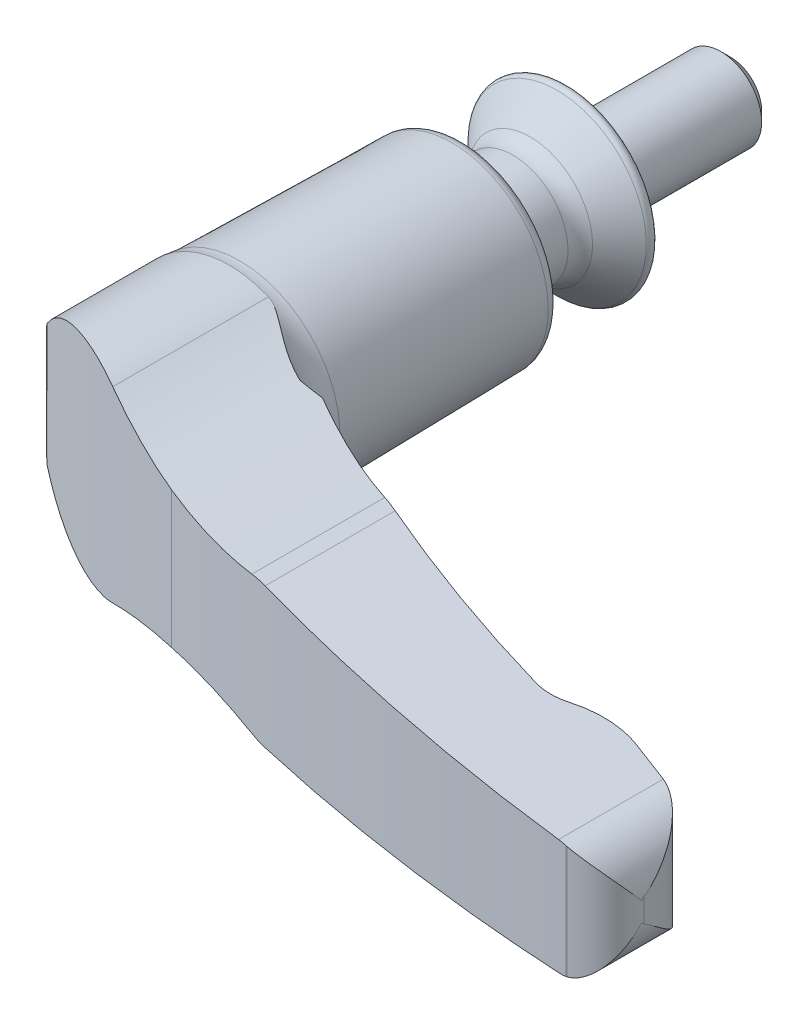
ISO-10303-21;
HEADER;
FILE_DESCRIPTION(('STEP AP214'),'2;1');
FILE_NAME('part.step','',(''),(''),'','','');
FILE_SCHEMA(('AUTOMOTIVE_DESIGN { 1 0 10303 214 1 1 1 1 }'));
ENDSEC;
DATA;
#1=APPLICATION_CONTEXT('core data for automotive mechanical design processes');
#2=APPLICATION_PROTOCOL_DEFINITION('international standard','automotive_design',2000,#1);
#3=PRODUCT_CONTEXT('',#1,'mechanical');
#4=PRODUCT('Part','Part','',(#3));
#5=PRODUCT_RELATED_PRODUCT_CATEGORY('part','',(#4));
#6=PRODUCT_DEFINITION_FORMATION('','',#4);
#7=PRODUCT_DEFINITION_CONTEXT('part definition',#1,'design');
#8=PRODUCT_DEFINITION('design','',#6,#7);
#9=PRODUCT_DEFINITION_SHAPE('','',#8);
#10=(LENGTH_UNIT() NAMED_UNIT(*) SI_UNIT(.MILLI.,.METRE.));
#11=(NAMED_UNIT(*) PLANE_ANGLE_UNIT() SI_UNIT($,.RADIAN.));
#12=(NAMED_UNIT(*) SI_UNIT($,.STERADIAN.) SOLID_ANGLE_UNIT());
#13=UNCERTAINTY_MEASURE_WITH_UNIT(LENGTH_MEASURE(1.E-05),#10,'distance_accuracy_value','');
#14=(GEOMETRIC_REPRESENTATION_CONTEXT(3) GLOBAL_UNCERTAINTY_ASSIGNED_CONTEXT((#13)) GLOBAL_UNIT_ASSIGNED_CONTEXT((#10,
#11,#12)) REPRESENTATION_CONTEXT('',''));
#15=CARTESIAN_POINT('',(0.,0.,0.));
#16=DIRECTION('',(0.,0.,1.));
#17=DIRECTION('',(1.,0.,0.));
#18=AXIS2_PLACEMENT_3D('',#15,#16,#17);
#19=CARTESIAN_POINT('',(-12.2494442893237,-13.45,40.2250875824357));
#20=DIRECTION('',(0.,0.,1.));
#21=DIRECTION('',(-1.,0.,0.));
#22=AXIS2_PLACEMENT_3D('',#19,#20,#21);
#23=PLANE('',#22);
#24=DIRECTION('',(0.,1.,0.));
#25=VECTOR('',#24,1.);
#26=CARTESIAN_POINT('',(-12.2494442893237,-13.45,40.2250875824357));
#27=LINE('',#26,#25);
#28=CARTESIAN_POINT('',(-12.2494442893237,-1.12726551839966,40.2250875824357));
#29=VERTEX_POINT('',#28);
#30=CARTESIAN_POINT('',(-12.2494442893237,0.,40.2250875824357));
#31=VERTEX_POINT('',#30);
#32=EDGE_CURVE('E175',#29,#31,#27,.T.);
#33=ORIENTED_EDGE('',*,*,#32,.T.);
#34=CARTESIAN_POINT('',(-1.62642046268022E-13,0.,40.2250875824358));
#35=DIRECTION('',(0.,0.,1.));
#36=DIRECTION('',(-1.,0.,0.));
#37=AXIS2_PLACEMENT_3D('',#34,#35,#36);
#38=CIRCLE('',#37,12.2494442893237);
#39=EDGE_CURVE('E178',#31,#31,#38,.F.);
#40=ORIENTED_EDGE('',*,*,#39,.F.);
#41=CARTESIAN_POINT('',(-12.2494442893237,1.12726551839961,40.2250875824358));
#42=VERTEX_POINT('',#41);
#43=EDGE_CURVE('E185',#31,#42,#27,.T.);
#44=ORIENTED_EDGE('',*,*,#43,.T.);
#45=CARTESIAN_POINT('',(0.,0.,40.2250875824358));
#46=DIRECTION('',(0.,0.,-1.));
#47=DIRECTION('',(1.,0.,0.));
#48=AXIS2_PLACEMENT_3D('',#45,#46,#47);
#49=CIRCLE('',#48,12.3012037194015);
#50=EDGE_CURVE('E180',#42,#29,#49,.T.);
#51=ORIENTED_EDGE('',*,*,#50,.T.);
#52=EDGE_LOOP('',(#33,#40,#44,#51));
#53=FACE_BOUND('',#52,.T.);
#54=ADVANCED_FACE('F14',(#53),#23,.F.);
#55=CARTESIAN_POINT('',(-12.3990914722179,-13.45,48.8947231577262));
#56=DIRECTION('',(0.999851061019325,0.,0.0172584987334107));
#57=DIRECTION('',(-0.0172584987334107,0.,0.999851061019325));
#58=AXIS2_PLACEMENT_3D('',#55,#56,#57);
#59=PLANE('',#58);
#60=ORIENTED_EDGE('',*,*,#43,.F.);
#61=ORIENTED_EDGE('',*,*,#32,.F.);
#62=CARTESIAN_POINT('',(-12.2494408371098,-1.12726105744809,40.2248875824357));
#63=CARTESIAN_POINT('',(-12.2501546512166,-1.12801102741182,40.2662415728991));
#64=CARTESIAN_POINT('',(-12.2508608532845,-1.13338949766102,40.3071545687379));
#65=CARTESIAN_POINT('',(-12.2522296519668,-1.15131266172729,40.3864543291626));
#66=CARTESIAN_POINT('',(-12.2528928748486,-1.16369170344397,40.4248773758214));
#67=CARTESIAN_POINT('',(-12.254538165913,-1.20206398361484,40.520195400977));
#68=CARTESIAN_POINT('',(-12.255493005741,-1.23180007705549,40.575512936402));
#69=CARTESIAN_POINT('',(-12.257344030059,-1.29909643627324,40.6827498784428));
#70=CARTESIAN_POINT('',(-12.2582382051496,-1.33683049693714,40.7345528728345));
#71=CARTESIAN_POINT('',(-12.2604895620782,-1.44052319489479,40.8649826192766));
#72=CARTESIAN_POINT('',(-12.2618006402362,-1.50977612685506,40.9409384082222));
#73=CARTESIAN_POINT('',(-12.264338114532,-1.65349391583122,41.0879440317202));
#74=CARTESIAN_POINT('',(-12.2655642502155,-1.72797350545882,41.1589787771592));
#75=CARTESIAN_POINT('',(-12.2678450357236,-1.87254522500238,41.2911134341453));
#76=CARTESIAN_POINT('',(-12.268904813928,-1.94236687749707,41.3525104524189));
#77=CARTESIAN_POINT('',(-12.2709847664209,-2.08326818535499,41.4730100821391));
#78=CARTESIAN_POINT('',(-12.2720051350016,-2.15433817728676,41.5321239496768));
#79=CARTESIAN_POINT('',(-12.2730148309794,-2.22587171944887,41.5906195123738));
#80=B_SPLINE_CURVE_WITH_KNOTS('',3,(#62,#63,#64,#65,#66,#67,#68,#69,#70,#71,#72,#73,#74,#75,#76,
#77,#78,#79),.UNSPECIFIED.,.F.,.F.,(4,2,2,2,2,2,2,2,4),(0.,0.123330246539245,0.243857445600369,
0.431247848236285,0.623227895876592,0.931023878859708,1.23972530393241,1.51862793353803,
1.79591047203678),.UNSPECIFIED.);
#81=CARTESIAN_POINT('',(-12.271249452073,-2.10212675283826,41.4883443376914));
#82=VERTEX_POINT('',#81);
#83=EDGE_CURVE('E399',#29,#82,#80,.T.);
#84=ORIENTED_EDGE('',*,*,#83,.T.);
#85=CARTESIAN_POINT('',(0.,0.,-669.432227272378));
#86=DIRECTION('',(0.999851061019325,0.,0.0172584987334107));
#87=DIRECTION('',(0.0172584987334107,0.,-0.999851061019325));
#88=AXIS2_PLACEMENT_3D('',#85,#86,#87);
#89=ELLIPSE('',#88,721.383718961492,12.45);
#90=CARTESIAN_POINT('',(-12.3990914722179,-1.12473581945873,48.8947231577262));
#91=VERTEX_POINT('',#90);
#92=EDGE_CURVE('E239',#82,#91,#89,.F.);
#93=ORIENTED_EDGE('',*,*,#92,.T.);
#94=DIRECTION('',(0.,1.,0.));
#95=VECTOR('',#94,1.);
#96=CARTESIAN_POINT('',(-12.3990914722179,-13.45,48.8947231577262));
#97=LINE('',#96,#95);
#98=CARTESIAN_POINT('',(-12.3990914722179,1.12473581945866,48.8947231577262));
#99=VERTEX_POINT('',#98);
#100=EDGE_CURVE('E184',#91,#99,#97,.T.);
#101=ORIENTED_EDGE('',*,*,#100,.T.);
#102=CARTESIAN_POINT('',(0.,0.,-669.432227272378));
#103=DIRECTION('',(0.999851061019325,0.,0.0172584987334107));
#104=DIRECTION('',(0.0172584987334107,0.,-0.999851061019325));
#105=AXIS2_PLACEMENT_3D('',#102,#103,#104);
#106=ELLIPSE('',#105,721.383718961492,12.45);
#107=CARTESIAN_POINT('',(-12.271249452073,2.10212675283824,41.4883443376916));
#108=VERTEX_POINT('',#107);
#109=EDGE_CURVE('E263',#99,#108,#106,.F.);
#110=ORIENTED_EDGE('',*,*,#109,.T.);
#111=CARTESIAN_POINT('',(-12.2730148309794,2.2258717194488,41.5906195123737));
#112=CARTESIAN_POINT('',(-12.2723484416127,2.17857656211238,41.5520130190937));
#113=CARTESIAN_POINT('',(-12.2716768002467,2.13153645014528,41.5131022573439));
#114=CARTESIAN_POINT('',(-12.2703199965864,2.03804940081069,41.4344974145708));
#115=CARTESIAN_POINT('',(-12.269634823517,1.99160298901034,41.3948027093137));
#116=CARTESIAN_POINT('',(-12.2675030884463,1.84986894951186,41.2713031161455));
#117=CARTESIAN_POINT('',(-12.2660309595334,1.75583214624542,41.1860170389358));
#118=CARTESIAN_POINT('',(-12.2637374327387,1.61936868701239,41.0531442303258));
#119=CARTESIAN_POINT('',(-12.2629577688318,1.574598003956,41.0079753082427));
#120=CARTESIAN_POINT('',(-12.2613598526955,1.48744881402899,40.9154018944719));
#121=CARTESIAN_POINT('',(-12.2605416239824,1.44506888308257,40.8679987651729));
#122=CARTESIAN_POINT('',(-12.2588634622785,1.36463549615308,40.7707764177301));
#123=CARTESIAN_POINT('',(-12.2580043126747,1.32652790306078,40.7210025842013));
#124=CARTESIAN_POINT('',(-12.2562147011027,1.25655247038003,40.6173235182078));
#125=CARTESIAN_POINT('',(-12.2552845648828,1.22465826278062,40.5634371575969));
#126=CARTESIAN_POINT('',(-12.2536883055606,1.18138793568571,40.4709597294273));
#127=CARTESIAN_POINT('',(-12.2530490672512,1.16676743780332,40.4339262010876));
#128=CARTESIAN_POINT('',(-12.2517389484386,1.14385333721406,40.3580259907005));
#129=CARTESIAN_POINT('',(-12.251068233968,1.13552979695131,40.3191689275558));
#130=CARTESIAN_POINT('',(-12.2500751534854,1.12891545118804,40.2616359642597));
#131=CARTESIAN_POINT('',(-12.2497582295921,1.12764004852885,40.2432753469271));
#132=CARTESIAN_POINT('',(-12.2494408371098,1.12726105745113,40.2248875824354));
#133=B_SPLINE_CURVE_WITH_KNOTS('',3,(#111,#112,#113,#114,#115,#116,#117,#118,#119,#120,#121,
#122,#123,#124,#125,#126,#127,#128,#129,#130,#131,#132),.UNSPECIFIED.,.F.,.F.,(4,2,2,2,2,2,2,2,
2,2,4),(0.,0.183152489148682,0.366457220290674,0.747103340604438,0.937859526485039,
1.12850085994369,1.31635856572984,1.50340080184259,1.62247471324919,1.74097889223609,
1.79613687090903),.UNSPECIFIED.);
#134=EDGE_CURVE('E190',#108,#42,#133,.T.);
#135=ORIENTED_EDGE('',*,*,#134,.T.);
#136=EDGE_LOOP('',(#60,#61,#84,#93,#101,#110,#135));
#137=FACE_BOUND('',#136,.T.);
#138=ADVANCED_FACE('F188',(#137),#59,.F.);
#139=CARTESIAN_POINT('',(111.767919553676,-13.45,-139.797819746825));
#140=DIRECTION('',(0.,1.,0.));
#141=DIRECTION('',(-1.,0.,0.));
#142=AXIS2_PLACEMENT_3D('',#139,#140,#141);
#143=CYLINDRICAL_SURFACE('',#142,208.999999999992);
#144=DIRECTION('',(0.,1.,0.));
#145=VECTOR('',#144,1.);
#146=CARTESIAN_POINT('',(15.7999999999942,-13.45,45.8662812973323));
#147=LINE('',#146,#145);
#148=CARTESIAN_POINT('',(15.8,-8.43613014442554,45.8662812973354));
#149=VERTEX_POINT('',#148);
#150=CARTESIAN_POINT('',(15.8,0.,45.8662812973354));
#151=VERTEX_POINT('',#150);
#152=EDGE_CURVE('E191',#149,#151,#147,.T.);
#153=ORIENTED_EDGE('',*,*,#152,.T.);
#154=DIRECTION('',(0.,1.,0.));
#155=VECTOR('',#154,1.);
#156=CARTESIAN_POINT('',(15.8,-13.45,45.8662812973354));
#157=LINE('',#156,#155);
#158=CARTESIAN_POINT('',(15.7999999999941,8.43613014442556,45.8662812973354));
#159=VERTEX_POINT('',#158);
#160=EDGE_CURVE('E413',#159,#151,#157,.F.);
#161=ORIENTED_EDGE('',*,*,#160,.F.);
#162=CARTESIAN_POINT('',(15.7999999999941,8.43613014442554,45.8662812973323));
#163=CARTESIAN_POINT('',(16.3870365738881,8.34717375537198,46.1697176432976));
#164=CARTESIAN_POINT('',(16.9767713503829,8.26904045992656,46.4710139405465));
#165=CARTESIAN_POINT('',(18.161091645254,8.13475115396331,47.0689822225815));
#166=CARTESIAN_POINT('',(18.7556773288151,8.07859589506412,47.3656540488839));
#167=CARTESIAN_POINT('',(20.5395968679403,7.94407204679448,48.2451118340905));
#168=CARTESIAN_POINT('',(21.7352391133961,7.89871013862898,48.8205177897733));
#169=CARTESIAN_POINT('',(24.1374209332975,7.89893976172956,49.9484747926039));
#170=CARTESIAN_POINT('',(25.3439611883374,7.94453701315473,50.5010244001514));
#171=CARTESIAN_POINT('',(27.1599173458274,8.0830634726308,51.3119106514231));
#172=CARTESIAN_POINT('',(27.7678474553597,8.14117035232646,51.5798888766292));
#173=CARTESIAN_POINT('',(28.9839481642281,8.28117670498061,52.1090693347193));
#174=CARTESIAN_POINT('',(29.5921187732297,8.36307725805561,52.370271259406));
#175=CARTESIAN_POINT('',(30.2000000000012,8.45699782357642,52.6279438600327));
#176=B_SPLINE_CURVE_WITH_KNOTS('',3,(#162,#163,#164,#165,#166,#167,#168,#169,#170,#171,#172,
#173,#174,#175),.UNSPECIFIED.,.F.,.F.,(4,2,2,2,2,2,4),(0.,2.00016069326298,4.00038978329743,
7.97994863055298,11.9597577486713,13.9600808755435,15.9604948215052),.UNSPECIFIED.);
#177=CARTESIAN_POINT('',(30.2000000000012,8.45699782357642,52.6279438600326));
#178=VERTEX_POINT('',#177);
#179=EDGE_CURVE('E264',#159,#178,#176,.T.);
#180=ORIENTED_EDGE('',*,*,#179,.T.);
#181=CARTESIAN_POINT('',(32.4002231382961,8.59297245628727,53.5458348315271));
#182=CARTESIAN_POINT('',(32.2157966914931,8.59945246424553,53.4701291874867));
#183=CARTESIAN_POINT('',(32.0313583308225,8.60144694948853,53.3941076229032));
#184=CARTESIAN_POINT('',(31.6631700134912,8.59650662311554,53.2417318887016));
#185=CARTESIAN_POINT('',(31.4794194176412,8.58958963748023,53.1653786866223));
#186=CARTESIAN_POINT('',(30.9288846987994,8.55552869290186,52.9356990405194));
#187=CARTESIAN_POINT('',(30.5630943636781,8.51506518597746,52.7818661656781));
#188=CARTESIAN_POINT('',(30.2000000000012,8.45699782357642,52.6279438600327));
#189=B_SPLINE_CURVE_WITH_KNOTS('',3,(#181,#182,#183,#184,#185,#186,#187,#188),.UNSPECIFIED.,.F.,
.F.,(4,2,2,4),(0.,0.598316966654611,1.19543895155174,2.3905773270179),.UNSPECIFIED.);
#190=CARTESIAN_POINT('',(32.4002231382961,8.59297245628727,53.5458348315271));
#191=VERTEX_POINT('',#190);
#192=EDGE_CURVE('E342',#191,#178,#189,.T.);
#193=ORIENTED_EDGE('',*,*,#192,.F.);
#194=CARTESIAN_POINT('',(111.767919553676,5.80486876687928,-139.797819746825));
#195=DIRECTION('',(-0.0351072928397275,-0.999383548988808,0.));
#196=DIRECTION('',(-0.999383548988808,0.0351072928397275,0.));
#197=AXIS2_PLACEMENT_3D('',#194,#195,#196);
#198=ELLIPSE('',#197,209.128917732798,208.999999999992);
#199=CARTESIAN_POINT('',(58.4999999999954,7.67611474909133,62.2999999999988));
#200=VERTEX_POINT('',#199);
#201=EDGE_CURVE('E350',#200,#191,#198,.T.);
#202=ORIENTED_EDGE('',*,*,#201,.F.);
#203=DIRECTION('',(0.,1.,0.));
#204=VECTOR('',#203,1.);
#205=CARTESIAN_POINT('',(58.4999999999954,-13.45,62.2999999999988));
#206=LINE('',#205,#204);
#207=CARTESIAN_POINT('',(58.4999999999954,-7.67611474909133,62.2999999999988));
#208=VERTEX_POINT('',#207);
#209=EDGE_CURVE('E193',#208,#200,#206,.T.);
#210=ORIENTED_EDGE('',*,*,#209,.F.);
#211=CARTESIAN_POINT('',(111.767919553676,-5.80486876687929,-139.797819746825));
#212=DIRECTION('',(-0.0351072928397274,0.999383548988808,0.));
#213=DIRECTION('',(0.999383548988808,0.0351072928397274,0.));
#214=AXIS2_PLACEMENT_3D('',#211,#212,#213);
#215=ELLIPSE('',#214,209.128917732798,208.999999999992);
#216=CARTESIAN_POINT('',(32.4002231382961,-8.59297245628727,53.5458348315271));
#217=VERTEX_POINT('',#216);
#218=EDGE_CURVE('E817',#217,#208,#215,.T.);
#219=ORIENTED_EDGE('',*,*,#218,.F.);
#220=CARTESIAN_POINT('',(30.2000000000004,-8.45699782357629,52.6279438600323));
#221=CARTESIAN_POINT('',(30.5630943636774,-8.51506518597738,52.7818661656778));
#222=CARTESIAN_POINT('',(30.9288846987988,-8.55552869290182,52.9356990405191));
#223=CARTESIAN_POINT('',(31.4794194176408,-8.58958963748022,53.1653786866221));
#224=CARTESIAN_POINT('',(31.6631700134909,-8.59650662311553,53.2417318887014));
#225=CARTESIAN_POINT('',(32.0313583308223,-8.60144694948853,53.3941076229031));
#226=CARTESIAN_POINT('',(32.215796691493,-8.59945246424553,53.4701291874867));
#227=CARTESIAN_POINT('',(32.4002231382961,-8.59297245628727,53.5458348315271));
#228=B_SPLINE_CURVE_WITH_KNOTS('',3,(#220,#221,#222,#223,#224,#225,#226,#227),.UNSPECIFIED.,.F.,
.F.,(4,2,2,4),(0.,1.19513837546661,1.79226036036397,2.39057732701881),.UNSPECIFIED.);
#229=CARTESIAN_POINT('',(30.2000000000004,-8.45699782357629,52.6279438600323));
#230=VERTEX_POINT('',#229);
#231=EDGE_CURVE('E317',#230,#217,#228,.T.);
#232=ORIENTED_EDGE('',*,*,#231,.F.);
#233=CARTESIAN_POINT('',(30.2,-8.45699782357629,52.6279438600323));
#234=CARTESIAN_POINT('',(29.5921187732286,-8.36307725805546,52.3702712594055));
#235=CARTESIAN_POINT('',(28.983948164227,-8.28117670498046,52.1090693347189));
#236=CARTESIAN_POINT('',(27.7678474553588,-8.14117035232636,51.5798888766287));
#237=CARTESIAN_POINT('',(27.1599173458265,-8.08306347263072,51.3119106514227));
#238=CARTESIAN_POINT('',(25.3439611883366,-7.94453701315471,50.5010244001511));
#239=CARTESIAN_POINT('',(24.1374209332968,-7.89893976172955,49.9484747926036));
#240=CARTESIAN_POINT('',(21.7352391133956,-7.89871013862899,48.820517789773));
#241=CARTESIAN_POINT('',(20.5395968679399,-7.9440720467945,48.2451118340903));
#242=CARTESIAN_POINT('',(18.7556773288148,-8.07859589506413,47.3656540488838));
#243=CARTESIAN_POINT('',(18.1610916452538,-8.13475115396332,47.0689822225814));
#244=CARTESIAN_POINT('',(16.9767713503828,-8.26904045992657,46.4710139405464));
#245=CARTESIAN_POINT('',(16.387036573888,-8.34717375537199,46.1697176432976));
#246=CARTESIAN_POINT('',(15.7999999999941,-8.43613014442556,45.8662812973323));
#247=B_SPLINE_CURVE_WITH_KNOTS('',3,(#233,#234,#235,#236,#237,#238,#239,#240,#241,#242,#243,
#244,#245,#246),.UNSPECIFIED.,.F.,.F.,(4,2,2,2,2,2,4),(0.,2.00041394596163,4.00073707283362,
7.98054619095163,11.9601050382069,13.9603341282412,15.960494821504),.UNSPECIFIED.);
#248=EDGE_CURVE('E335',#230,#149,#247,.T.);
#249=ORIENTED_EDGE('',*,*,#248,.T.);
#250=EDGE_LOOP('',(#153,#161,#180,#193,#202,#210,#219,#232,#249));
#251=FACE_BOUND('',#250,.T.);
#252=ADVANCED_FACE('F325',(#251),#143,.F.);
#253=CARTESIAN_POINT('',(76.9,-13.45,77.));
#254=DIRECTION('',(0.,0.,-1.));
#255=DIRECTION('',(0.,1.,0.));
#256=AXIS2_PLACEMENT_3D('',#253,#254,#255);
#257=PLANE('',#256);
#258=DIRECTION('',(0.,1.,0.));
#259=VECTOR('',#258,1.);
#260=CARTESIAN_POINT('',(76.9,-13.45,77.));
#261=LINE('',#260,#259);
#262=CARTESIAN_POINT('',(76.9,-6.92676825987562,77.));
#263=VERTEX_POINT('',#262);
#264=CARTESIAN_POINT('',(76.9,6.92676825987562,77.));
#265=VERTEX_POINT('',#264);
#266=EDGE_CURVE('E790',#263,#265,#261,.T.);
#267=ORIENTED_EDGE('',*,*,#266,.T.);
#268=CARTESIAN_POINT('',(75.6,1.17177043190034,77.));
#269=DIRECTION('',(0.,0.,-1.));
#270=DIRECTION('',(0.,1.,0.));
#271=AXIS2_PLACEMENT_3D('',#268,#269,#270);
#272=CIRCLE('',#271,5.9);
#273=CARTESIAN_POINT('',(76.8,6.94844767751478,77.));
#274=VERTEX_POINT('',#273);
#275=EDGE_CURVE('E860',#265,#274,#272,.F.);
#276=ORIENTED_EDGE('',*,*,#275,.T.);
#277=DIRECTION('',(0.,1.,0.));
#278=VECTOR('',#277,1.);
#279=CARTESIAN_POINT('',(76.8,-13.45,77.));
#280=LINE('',#279,#278);
#281=CARTESIAN_POINT('',(76.8,-6.94844767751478,77.));
#282=VERTEX_POINT('',#281);
#283=EDGE_CURVE('E788',#282,#274,#280,.T.);
#284=ORIENTED_EDGE('',*,*,#283,.F.);
#285=CARTESIAN_POINT('',(75.6,-1.17177043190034,77.));
#286=DIRECTION('',(0.,0.,-1.));
#287=DIRECTION('',(0.,1.,0.));
#288=AXIS2_PLACEMENT_3D('',#285,#286,#287);
#289=CIRCLE('',#288,5.9);
#290=EDGE_CURVE('E903',#282,#263,#289,.F.);
#291=ORIENTED_EDGE('',*,*,#290,.T.);
#292=EDGE_LOOP('',(#267,#276,#284,#291));
#293=FACE_BOUND('',#292,.T.);
#294=ADVANCED_FACE('F329',(#293),#257,.F.);
#295=CARTESIAN_POINT('',(99.3774025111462,-13.45,-191.753327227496));
#296=DIRECTION('',(0.,1.,0.));
#297=DIRECTION('',(-1.,0.,0.));
#298=AXIS2_PLACEMENT_3D('',#295,#296,#297);
#299=CYLINDRICAL_SURFACE('',#298,269.7);
#300=CARTESIAN_POINT('',(16.1999999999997,8.37725139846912,64.8));
#301=CARTESIAN_POINT('',(16.7767031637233,8.29486390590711,64.9869756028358));
#302=CARTESIAN_POINT('',(17.3553557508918,8.22300064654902,65.1724296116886));
#303=CARTESIAN_POINT('',(18.5159500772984,8.10050516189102,65.5400576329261));
#304=CARTESIAN_POINT('',(19.0978918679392,8.04987326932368,65.7222315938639));
#305=CARTESIAN_POINT('',(20.8414876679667,7.93052773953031,66.2615450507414));
#306=CARTESIAN_POINT('',(22.0070770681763,7.89348273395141,66.6134754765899));
#307=CARTESIAN_POINT('',(24.3425845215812,7.90540743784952,67.3013928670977));
#308=CARTESIAN_POINT('',(25.512502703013,7.95437971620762,67.6373793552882));
#309=CARTESIAN_POINT('',(27.2687809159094,8.09314767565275,68.1289718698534));
#310=CARTESIAN_POINT('',(27.8560018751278,8.15052863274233,68.2911856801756));
#311=CARTESIAN_POINT('',(29.0291528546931,8.28726693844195,68.611001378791));
#312=CARTESIAN_POINT('',(29.6150828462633,8.36662477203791,68.7686031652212));
#313=CARTESIAN_POINT('',(30.2000000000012,8.45699782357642,68.9238236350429));
#314=B_SPLINE_CURVE_WITH_KNOTS('',3,(#300,#301,#302,#303,#304,#305,#306,#307,#308,#309,#310,
#311,#312,#313),.UNSPECIFIED.,.F.,.F.,(4,2,2,2,2,2,4),(0.,1.83529834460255,3.6706254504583,
7.32170279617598,10.9728891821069,12.808257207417,14.6436657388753),.UNSPECIFIED.);
#315=CARTESIAN_POINT('',(16.1999999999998,8.37725139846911,64.8));
#316=VERTEX_POINT('',#315);
#317=CARTESIAN_POINT('',(30.2000000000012,8.45699782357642,68.9238236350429));
#318=VERTEX_POINT('',#317);
#319=EDGE_CURVE('E775',#316,#318,#314,.T.);
#320=ORIENTED_EDGE('',*,*,#319,.F.);
#321=DIRECTION('',(0.,1.,0.));
#322=VECTOR('',#321,1.);
#323=CARTESIAN_POINT('',(16.1999999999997,-13.45,64.8));
#324=LINE('',#323,#322);
#325=CARTESIAN_POINT('',(16.1999999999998,-8.37725139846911,64.8));
#326=VERTEX_POINT('',#325);
#327=EDGE_CURVE('E349',#326,#316,#324,.T.);
#328=ORIENTED_EDGE('',*,*,#327,.F.);
#329=CARTESIAN_POINT('',(30.2,-8.45699782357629,68.9238236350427));
#330=CARTESIAN_POINT('',(29.6150828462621,-8.36662477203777,68.7686031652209));
#331=CARTESIAN_POINT('',(29.029152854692,-8.28726693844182,68.6110013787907));
#332=CARTESIAN_POINT('',(27.8560018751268,-8.15052863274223,68.2911856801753));
#333=CARTESIAN_POINT('',(27.2687809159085,-8.09314767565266,68.1289718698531));
#334=CARTESIAN_POINT('',(25.5125027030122,-7.95437971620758,67.637379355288));
#335=CARTESIAN_POINT('',(24.3425845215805,-7.9054074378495,67.3013928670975));
#336=CARTESIAN_POINT('',(22.0070770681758,-7.89348273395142,66.6134754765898));
#337=CARTESIAN_POINT('',(20.8414876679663,-7.93052773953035,66.2615450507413));
#338=CARTESIAN_POINT('',(19.097891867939,-8.0498732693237,65.7222315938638));
#339=CARTESIAN_POINT('',(18.5159500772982,-8.10050516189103,65.540057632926));
#340=CARTESIAN_POINT('',(17.3553557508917,-8.22300064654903,65.1724296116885));
#341=CARTESIAN_POINT('',(16.7767031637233,-8.29486390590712,64.9869756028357));
#342=CARTESIAN_POINT('',(16.1999999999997,-8.37725139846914,64.8));
#343=B_SPLINE_CURVE_WITH_KNOTS('',3,(#329,#330,#331,#332,#333,#334,#335,#336,#337,#338,#339,
#340,#341,#342),.UNSPECIFIED.,.F.,.F.,(4,2,2,2,2,2,4),(0.,1.83540853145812,3.67077655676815,
7.32196294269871,10.9730402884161,12.8083673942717,14.6436657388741),.UNSPECIFIED.);
#344=CARTESIAN_POINT('',(30.2000000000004,-8.45699782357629,68.9238236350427));
#345=VERTEX_POINT('',#344);
#346=EDGE_CURVE('E446',#345,#326,#343,.T.);
#347=ORIENTED_EDGE('',*,*,#346,.F.);
#348=CARTESIAN_POINT('',(30.2000000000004,-8.45699782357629,68.9238236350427));
#349=CARTESIAN_POINT('',(30.5632894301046,-8.51510955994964,69.0202386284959));
#350=CARTESIAN_POINT('',(30.9292671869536,-8.55556829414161,69.1165394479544));
#351=CARTESIAN_POINT('',(31.4798508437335,-8.58960835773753,69.2601745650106));
#352=CARTESIAN_POINT('',(31.6635722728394,-8.5965163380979,69.3078974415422));
#353=CARTESIAN_POINT('',(32.0316308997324,-8.60144626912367,69.4030885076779));
#354=CARTESIAN_POINT('',(32.21596856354,-8.59944866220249,69.4505559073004));
#355=CARTESIAN_POINT('',(32.4002231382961,-8.59297245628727,69.4977922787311));
#356=B_SPLINE_CURVE_WITH_KNOTS('',3,(#348,#349,#350,#351,#352,#353,#354,#355),.UNSPECIFIED.,.F.,
.F.,(4,2,2,4),(0.,1.14021168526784,1.70984874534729,2.2807374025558),.UNSPECIFIED.);
#357=CARTESIAN_POINT('',(32.4002231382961,-8.59297245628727,69.497792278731));
#358=VERTEX_POINT('',#357);
#359=EDGE_CURVE('E292',#345,#358,#356,.T.);
#360=ORIENTED_EDGE('',*,*,#359,.T.);
#361=CARTESIAN_POINT('',(99.3774025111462,-6.24013459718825,-191.753327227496));
#362=DIRECTION('',(-0.0351072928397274,0.999383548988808,0.));
#363=DIRECTION('',(0.999383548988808,0.0351072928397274,0.));
#364=AXIS2_PLACEMENT_3D('',#361,#362,#363);
#365=ELLIPSE('',#364,269.866359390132,269.7);
#366=CARTESIAN_POINT('',(75.8071330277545,-7.06813337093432,76.9147438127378));
#367=VERTEX_POINT('',#366);
#368=EDGE_CURVE('E304',#358,#367,#365,.T.);
#369=ORIENTED_EDGE('',*,*,#368,.T.);
#370=CARTESIAN_POINT('',(75.8071330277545,-7.06813337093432,76.9147438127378));
#371=CARTESIAN_POINT('',(75.9742663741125,-7.06223993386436,76.929403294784));
#372=CARTESIAN_POINT('',(76.1405719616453,-7.04931940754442,76.943837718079));
#373=CARTESIAN_POINT('',(76.4715276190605,-7.00942417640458,76.9722564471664));
#374=CARTESIAN_POINT('',(76.6361776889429,-6.98244947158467,76.9862407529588));
#375=CARTESIAN_POINT('',(76.8,-6.94844767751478,77.));
#376=B_SPLINE_CURVE_WITH_KNOTS('',3,(#370,#371,#372,#373,#374,#375),.UNSPECIFIED.,.F.,.F.,(4,2,
4),(0.,0.50229032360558,1.00458064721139),.UNSPECIFIED.);
#377=EDGE_CURVE('E905',#367,#282,#376,.T.);
#378=ORIENTED_EDGE('',*,*,#377,.T.);
#379=ORIENTED_EDGE('',*,*,#283,.T.);
#380=CARTESIAN_POINT('',(76.8,6.94844767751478,77.));
#381=CARTESIAN_POINT('',(76.6361776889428,6.98244947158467,76.9862407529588));
#382=CARTESIAN_POINT('',(76.4715276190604,7.00942417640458,76.9722564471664));
#383=CARTESIAN_POINT('',(76.1405719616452,7.04931940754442,76.943837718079));
#384=CARTESIAN_POINT('',(75.9742663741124,7.06223993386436,76.929403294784));
#385=CARTESIAN_POINT('',(75.8071330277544,7.06813337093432,76.9147438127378));
#386=B_SPLINE_CURVE_WITH_KNOTS('',3,(#380,#381,#382,#383,#384,#385),.UNSPECIFIED.,.F.,.F.,(4,2,
4),(0.,0.502290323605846,1.00458064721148),.UNSPECIFIED.);
#387=CARTESIAN_POINT('',(75.8071330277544,7.06813337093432,76.9147438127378));
#388=VERTEX_POINT('',#387);
#389=EDGE_CURVE('E847',#274,#388,#386,.T.);
#390=ORIENTED_EDGE('',*,*,#389,.T.);
#391=CARTESIAN_POINT('',(99.3774025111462,6.24013459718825,-191.753327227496));
#392=DIRECTION('',(-0.0351072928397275,-0.999383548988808,0.));
#393=DIRECTION('',(-0.999383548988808,0.0351072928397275,0.));
#394=AXIS2_PLACEMENT_3D('',#391,#392,#393);
#395=ELLIPSE('',#394,269.866359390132,269.7);
#396=CARTESIAN_POINT('',(32.4002231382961,8.59297245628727,69.497792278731));
#397=VERTEX_POINT('',#396);
#398=EDGE_CURVE('E372',#388,#397,#395,.T.);
#399=ORIENTED_EDGE('',*,*,#398,.T.);
#400=CARTESIAN_POINT('',(32.4002231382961,8.59297245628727,69.497792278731));
#401=CARTESIAN_POINT('',(32.2159685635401,8.59944866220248,69.4505559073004));
#402=CARTESIAN_POINT('',(32.0316308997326,8.60144626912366,69.4030885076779));
#403=CARTESIAN_POINT('',(31.6635722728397,8.5965163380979,69.3078974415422));
#404=CARTESIAN_POINT('',(31.4798508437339,8.58960835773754,69.2601745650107));
#405=CARTESIAN_POINT('',(30.9292671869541,8.55556829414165,69.1165394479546));
#406=CARTESIAN_POINT('',(30.5632894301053,8.51510955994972,69.0202386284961));
#407=CARTESIAN_POINT('',(30.2000000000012,8.45699782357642,68.9238236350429));
#408=B_SPLINE_CURVE_WITH_KNOTS('',3,(#400,#401,#402,#403,#404,#405,#406,#407),.UNSPECIFIED.,.F.,
.F.,(4,2,2,4),(0.,0.5708886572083,1.14052571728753,2.28073740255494),.UNSPECIFIED.);
#409=EDGE_CURVE('E363',#397,#318,#408,.T.);
#410=ORIENTED_EDGE('',*,*,#409,.T.);
#411=EDGE_LOOP('',(#320,#328,#347,#360,#369,#378,#379,#390,#399,#410));
#412=FACE_BOUND('',#411,.T.);
#413=ADVANCED_FACE('F306',(#412),#299,.T.);
#414=CARTESIAN_POINT('',(79.8840849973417,-13.45,-124.78991881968));
#415=DIRECTION('',(0.,1.,0.));
#416=DIRECTION('',(-1.,0.,0.));
#417=AXIS2_PLACEMENT_3D('',#414,#415,#416);
#418=CYLINDRICAL_SURFACE('',#417,200.000000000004);
#419=DIRECTION('',(0.,1.,0.));
#420=VECTOR('',#419,1.);
#421=CARTESIAN_POINT('',(-9.90000000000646,-13.45,53.9244289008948));
#422=LINE('',#421,#420);
#423=CARTESIAN_POINT('',(-9.90000000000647,-7.54933771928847,53.9244289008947));
#424=VERTEX_POINT('',#423);
#425=CARTESIAN_POINT('',(-9.90000000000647,7.54933771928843,53.9244289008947));
#426=VERTEX_POINT('',#425);
#427=EDGE_CURVE('E199',#424,#426,#422,.T.);
#428=ORIENTED_EDGE('',*,*,#427,.F.);
#429=CARTESIAN_POINT('',(-9.90000000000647,-7.54933771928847,53.9244289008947));
#430=CARTESIAN_POINT('',(-9.67451817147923,-7.84507120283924,54.0377127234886));
#431=CARTESIAN_POINT('',(-9.4368447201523,-8.12923310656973,54.1565790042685));
#432=CARTESIAN_POINT('',(-8.93966759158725,-8.67296304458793,54.403880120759));
#433=CARTESIAN_POINT('',(-8.68017587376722,-8.93254438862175,54.5323097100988));
#434=CARTESIAN_POINT('',(-8.14219185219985,-9.42550410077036,54.7970082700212));
#435=CARTESIAN_POINT('',(-7.86373776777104,-9.65893280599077,54.9332613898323));
#436=CARTESIAN_POINT('',(-7.28965149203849,-10.0992248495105,55.2124187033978));
#437=CARTESIAN_POINT('',(-6.994017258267,-10.3060850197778,55.3553236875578));
#438=CARTESIAN_POINT('',(-6.38843577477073,-10.6920089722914,55.6461218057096));
#439=CARTESIAN_POINT('',(-6.07851806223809,-10.8711270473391,55.7940044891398));
#440=CARTESIAN_POINT('',(-5.44596700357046,-11.2013953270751,56.0937585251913));
#441=CARTESIAN_POINT('',(-5.12333306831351,-11.3525442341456,56.2456300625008));
#442=CARTESIAN_POINT('',(-4.46756903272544,-11.6262415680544,56.5521043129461));
#443=CARTESIAN_POINT('',(-4.13444284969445,-11.7488005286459,56.7067059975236));
#444=CARTESIAN_POINT('',(-3.45976822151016,-11.9648655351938,57.0175072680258));
#445=CARTESIAN_POINT('',(-3.11822142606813,-12.0583772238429,57.1737065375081));
#446=CARTESIAN_POINT('',(-2.31903314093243,-12.2409805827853,57.5364253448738));
#447=CARTESIAN_POINT('',(-1.85895294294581,-12.3192478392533,57.743179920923));
#448=CARTESIAN_POINT('',(-1.16440659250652,-12.3976193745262,58.0521070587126));
#449=CARTESIAN_POINT('',(-0.932215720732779,-12.4172382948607,58.1548548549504));
#450=CARTESIAN_POINT('',(-0.466758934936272,-12.443430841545,58.3597645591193));
#451=CARTESIAN_POINT('',(-0.233492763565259,-12.4500011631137,58.4619263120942));
#452=CARTESIAN_POINT('',(0.405450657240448,-12.4499979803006,58.7403022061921));
#453=CARTESIAN_POINT('',(0.811584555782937,-12.4301810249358,58.9156432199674));
#454=CARTESIAN_POINT('',(1.62179032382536,-12.3506318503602,59.2622685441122));
#455=CARTESIAN_POINT('',(2.02586144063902,-12.2908859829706,59.4335514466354));
#456=CARTESIAN_POINT('',(2.83079805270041,-12.1308842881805,59.7716755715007));
#457=CARTESIAN_POINT('',(3.23162970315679,-12.030387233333,59.9384839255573));
#458=CARTESIAN_POINT('',(4.02384464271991,-11.7891025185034,60.2652335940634));
#459=CARTESIAN_POINT('',(4.41522782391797,-11.6483143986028,60.4251748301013));
#460=CARTESIAN_POINT('',(4.79999999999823,-11.4874931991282,60.5810071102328));
#461=B_SPLINE_CURVE_WITH_KNOTS('',3,(#429,#430,#431,#432,#433,#434,#435,#436,#437,#438,#439,
#440,#441,#442,#443,#444,#445,#446,#447,#448,#449,#450,#451,#452,#453,#454,#455,#456,#457,#458,
#459,#460),.UNSPECIFIED.,.F.,.F.,(4,2,2,2,2,2,2,2,2,2,2,2,2,2,2,4),(0.,1.16572536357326,
2.33081586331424,3.49362387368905,4.65657040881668,5.81721142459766,6.97790627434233,
8.1381727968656,9.29821378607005,10.8264676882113,11.5901890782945,12.3541038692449,
13.6806107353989,15.007571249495,16.3425041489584,17.67745228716),.UNSPECIFIED.);
#462=CARTESIAN_POINT('',(4.79999999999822,-11.4874931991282,60.5810071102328));
#463=VERTEX_POINT('',#462);
#464=EDGE_CURVE('E202',#424,#463,#461,.T.);
#465=ORIENTED_EDGE('',*,*,#464,.T.);
#466=CARTESIAN_POINT('',(16.1999999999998,-8.37725139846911,64.8));
#467=CARTESIAN_POINT('',(15.21368787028,-8.51813618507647,64.4687294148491));
#468=CARTESIAN_POINT('',(14.2339762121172,-8.68971619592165,64.1310391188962));
#469=CARTESIAN_POINT('',(12.2943158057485,-9.09213654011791,63.4457683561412));
#470=CARTESIAN_POINT('',(11.3343097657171,-9.32276678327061,63.0982267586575));
#471=CARTESIAN_POINT('',(9.43367460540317,-9.8421618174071,62.3938598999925));
#472=CARTESIAN_POINT('',(8.49304509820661,-10.1309254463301,62.0370348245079));
#473=CARTESIAN_POINT('',(6.63069309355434,-10.7662294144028,61.3147410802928));
#474=CARTESIAN_POINT('',(5.70904885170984,-11.1129696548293,60.9492463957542));
#475=CARTESIAN_POINT('',(4.79999999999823,-11.4874931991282,60.5810071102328));
#476=B_SPLINE_CURVE_WITH_KNOTS('',3,(#466,#467,#468,#469,#470,#471,#472,#473,#474,#475),
.UNSPECIFIED.,.F.,.F.,(4,2,2,2,4),(0.,3.14928931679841,6.2875260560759,9.42570006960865,
12.5749263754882),.UNSPECIFIED.);
#477=EDGE_CURVE('E211',#326,#463,#476,.T.);
#478=ORIENTED_EDGE('',*,*,#477,.F.);
#479=ORIENTED_EDGE('',*,*,#327,.T.);
#480=CARTESIAN_POINT('',(4.7999999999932,11.4874931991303,60.5810071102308));
#481=CARTESIAN_POINT('',(5.70904885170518,11.1129696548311,60.9492463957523));
#482=CARTESIAN_POINT('',(6.63069309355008,10.7662294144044,61.3147410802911));
#483=CARTESIAN_POINT('',(8.49304509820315,10.1309254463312,62.0370348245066));
#484=CARTESIAN_POINT('',(9.43367460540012,9.84216181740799,62.3938598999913));
#485=CARTESIAN_POINT('',(11.3343097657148,9.32276678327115,63.0982267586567));
#486=CARTESIAN_POINT('',(12.2943158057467,9.0921365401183,63.4457683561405));
#487=CARTESIAN_POINT('',(14.2339762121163,8.6897161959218,64.1310391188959));
#488=CARTESIAN_POINT('',(15.2136878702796,8.51813618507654,64.4687294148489));
#489=CARTESIAN_POINT('',(16.1999999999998,8.37725139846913,64.8));
#490=B_SPLINE_CURVE_WITH_KNOTS('',3,(#480,#481,#482,#483,#484,#485,#486,#487,#488,#489),
.UNSPECIFIED.,.F.,.F.,(4,2,2,2,4),(0.,3.14922630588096,6.28740031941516,9.42563705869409,
12.574926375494),.UNSPECIFIED.);
#491=CARTESIAN_POINT('',(4.7999999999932,11.4874931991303,60.5810071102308));
#492=VERTEX_POINT('',#491);
#493=EDGE_CURVE('E293',#492,#316,#490,.T.);
#494=ORIENTED_EDGE('',*,*,#493,.F.);
#495=CARTESIAN_POINT('',(4.79999999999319,11.4874931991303,60.5810071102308));
#496=CARTESIAN_POINT('',(4.41580947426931,11.6480694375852,60.425410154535));
#497=CARTESIAN_POINT('',(4.02503382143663,11.7886738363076,60.2657194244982));
#498=CARTESIAN_POINT('',(3.23419246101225,12.0296727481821,59.9395455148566));
#499=CARTESIAN_POINT('',(2.8341300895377,12.1300814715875,59.7730647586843));
#500=CARTESIAN_POINT('',(2.02936760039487,12.2903278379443,59.4350346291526));
#501=CARTESIAN_POINT('',(1.62468227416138,12.3502704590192,59.2634995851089));
#502=CARTESIAN_POINT('',(0.8131282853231,12.4301064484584,58.9163098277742));
#503=CARTESIAN_POINT('',(0.406259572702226,12.4499988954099,58.7406550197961));
#504=CARTESIAN_POINT('',(-0.381370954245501,12.4500010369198,58.3974981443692));
#505=CARTESIAN_POINT('',(-0.762205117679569,12.432473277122,58.230155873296));
#506=CARTESIAN_POINT('',(-1.52013839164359,12.3627058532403,57.8943010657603));
#507=CARTESIAN_POINT('',(-1.89723770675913,12.310468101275,57.7257885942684));
#508=CARTESIAN_POINT('',(-2.64540716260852,12.1716555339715,57.3887062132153));
#509=CARTESIAN_POINT('',(-3.0164722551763,12.0850533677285,57.2201363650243));
#510=CARTESIAN_POINT('',(-3.74968971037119,11.8780234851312,56.884389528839));
#511=CARTESIAN_POINT('',(-4.11184217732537,11.7575961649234,56.717212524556));
#512=CARTESIAN_POINT('',(-4.82530709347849,11.4832593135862,56.3853387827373));
#513=CARTESIAN_POINT('',(-5.17659902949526,11.329290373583,56.2206470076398));
#514=CARTESIAN_POINT('',(-5.86509267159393,10.9886630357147,55.8955080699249));
#515=CARTESIAN_POINT('',(-6.20229273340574,10.8020008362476,55.7350614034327));
#516=CARTESIAN_POINT('',(-6.85929279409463,10.3971732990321,55.4202886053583));
#517=CARTESIAN_POINT('',(-7.17912282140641,10.1790648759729,55.2659520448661));
#518=CARTESIAN_POINT('',(-7.79913838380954,9.71218172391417,54.9648338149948));
#519=CARTESIAN_POINT('',(-8.09933309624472,9.46342148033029,54.8180486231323));
#520=CARTESIAN_POINT('',(-8.6621015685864,8.9502892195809,54.5412436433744));
#521=CARTESIAN_POINT('',(-8.92582503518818,8.6874365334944,54.410747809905));
#522=CARTESIAN_POINT('',(-9.43052390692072,8.13678568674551,54.1597401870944));
#523=CARTESIAN_POINT('',(-9.67151657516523,7.8490067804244,54.03922082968));
#524=CARTESIAN_POINT('',(-9.90000000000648,7.54933771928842,53.9244289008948));
#525=B_SPLINE_CURVE_WITH_KNOTS('',3,(#495,#496,#497,#498,#499,#500,#501,#502,#503,#504,#505,
#506,#507,#508,#509,#510,#511,#512,#513,#514,#515,#516,#517,#518,#519,#520,#521,#522,#523,#524),
.UNSPECIFIED.,.F.,.F.,(4,2,2,2,2,2,2,2,2,2,2,2,2,2,4),(0.,1.33291829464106,2.66536494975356,
3.99434151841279,5.32334866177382,6.5709370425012,7.81845670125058,9.06697126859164,
10.3154712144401,11.5662007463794,12.8170758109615,14.0657146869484,15.3137657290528,
16.4958742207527,17.6770775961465),.UNSPECIFIED.);
#526=EDGE_CURVE('E286',#492,#426,#525,.T.);
#527=ORIENTED_EDGE('',*,*,#526,.T.);
#528=EDGE_LOOP('',(#428,#465,#478,#479,#494,#527));
#529=FACE_BOUND('',#528,.T.);
#530=ADVANCED_FACE('F248',(#529),#418,.T.);
#531=CARTESIAN_POINT('',(-6.3,-13.45,49.0000000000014));
#532=DIRECTION('',(0.,1.,0.));
#533=DIRECTION('',(-1.,0.,0.));
#534=AXIS2_PLACEMENT_3D('',#531,#532,#533);
#535=CYLINDRICAL_SURFACE('',#534,6.1);
#536=ORIENTED_EDGE('',*,*,#427,.T.);
#537=CARTESIAN_POINT('',(-9.90000000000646,7.54933771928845,53.9244289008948));
#538=CARTESIAN_POINT('',(-10.0046272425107,7.41212768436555,53.8479316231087));
#539=CARTESIAN_POINT('',(-10.1057058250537,7.27366477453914,53.7689319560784));
#540=CARTESIAN_POINT('',(-10.3008751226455,6.99453251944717,53.6064237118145));
#541=CARTESIAN_POINT('',(-10.3949674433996,6.8538636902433,53.5229161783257));
#542=CARTESIAN_POINT('',(-10.6668294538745,6.42916605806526,53.2664803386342));
#543=CARTESIAN_POINT('',(-10.8343792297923,6.14218866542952,53.0874940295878));
#544=CARTESIAN_POINT('',(-11.1421944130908,5.56422896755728,52.7176240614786));
#545=CARTESIAN_POINT('',(-11.2826072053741,5.27327804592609,52.5268125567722));
#546=CARTESIAN_POINT('',(-11.5382549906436,4.68755769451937,52.1345668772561));
#547=CARTESIAN_POINT('',(-11.6534929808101,4.39278872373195,51.9331339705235));
#548=CARTESIAN_POINT('',(-11.822924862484,3.90661945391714,51.5940966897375));
#549=CARTESIAN_POINT('',(-11.8842552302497,3.71572911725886,51.4592618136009));
#550=CARTESIAN_POINT('',(-11.9969703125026,3.33388552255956,51.1855148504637));
#551=CARTESIAN_POINT('',(-12.0483542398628,3.14293226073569,51.0466024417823));
#552=CARTESIAN_POINT('',(-12.1260618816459,2.82462255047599,50.8102464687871));
#553=CARTESIAN_POINT('',(-12.1550800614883,2.6969298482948,50.7141297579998));
#554=CARTESIAN_POINT('',(-12.2086854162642,2.44281059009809,50.5191072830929));
#555=CARTESIAN_POINT('',(-12.2332743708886,2.31638354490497,50.420202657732));
#556=CARTESIAN_POINT('',(-12.2704776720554,2.10831497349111,50.2522334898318));
#557=CARTESIAN_POINT('',(-12.2843345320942,2.02594231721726,50.1843484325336));
#558=CARTESIAN_POINT('',(-12.3100752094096,1.86314619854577,50.0459284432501));
#559=CARTESIAN_POINT('',(-12.3219596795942,1.78272209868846,49.9753943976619));
#560=CARTESIAN_POINT('',(-12.3424058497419,1.63475623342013,49.8387611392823));
#561=CARTESIAN_POINT('',(-12.3511943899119,1.56681696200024,49.7731262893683));
#562=CARTESIAN_POINT('',(-12.3670759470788,1.43603364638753,49.6366694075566));
#563=CARTESIAN_POINT('',(-12.3741715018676,1.37318207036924,49.5658553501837));
#564=CARTESIAN_POINT('',(-12.3830656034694,1.28954286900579,49.4555496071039));
#565=CARTESIAN_POINT('',(-12.3856658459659,1.26425474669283,49.4195939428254));
#566=CARTESIAN_POINT('',(-12.3903418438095,1.21756776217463,49.3451522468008));
#567=CARTESIAN_POINT('',(-12.3924179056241,1.19616662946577,49.3066677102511));
#568=CARTESIAN_POINT('',(-12.3955976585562,1.16270888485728,49.2340076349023));
#569=CARTESIAN_POINT('',(-12.3968091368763,1.14966347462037,49.2003044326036));
#570=CARTESIAN_POINT('',(-12.3986849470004,1.12925581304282,49.1312436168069));
#571=CARTESIAN_POINT('',(-12.3993512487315,1.12187310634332,49.0958924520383));
#572=CARTESIAN_POINT('',(-12.3999734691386,1.11497561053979,49.0327446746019));
#573=CARTESIAN_POINT('',(-12.4000585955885,1.11402993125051,49.0051039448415));
#574=CARTESIAN_POINT('',(-12.3998578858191,1.11624858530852,48.9497493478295));
#575=CARTESIAN_POINT('',(-12.399568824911,1.11944864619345,48.9220369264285));
#576=CARTESIAN_POINT('',(-12.3990914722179,1.12473581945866,48.8947231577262));
#577=B_SPLINE_CURVE_WITH_KNOTS('',3,(#537,#538,#539,#540,#541,#542,#543,#544,#545,#546,#547,
#548,#549,#550,#551,#552,#553,#554,#555,#556,#557,#558,#559,#560,#561,#562,#563,#564,#565,#566,
#567,#568,#569,#570,#571,#572,#573,#574,#575,#576),.UNSPECIFIED.,.F.,.F.,(4,2,2,2,2,2,2,2,2,2,2,
2,2,2,2,2,2,2,2,4),(0.,0.566113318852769,1.13209611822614,2.26300366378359,3.38758494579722,
4.5120322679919,5.23669041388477,5.96140588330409,6.44865012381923,6.93569814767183,
7.25857007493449,7.58133490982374,7.86586699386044,8.14996984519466,8.28191970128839,
8.41379223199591,8.52191310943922,8.6296415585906,8.71230660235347,8.79568880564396),.UNSPECIFIED.);
#578=EDGE_CURVE('E254',#426,#99,#577,.T.);
#579=ORIENTED_EDGE('',*,*,#578,.T.);
#580=ORIENTED_EDGE('',*,*,#100,.F.);
#581=CARTESIAN_POINT('',(-12.3990914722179,-1.12473581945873,48.8947231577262));
#582=CARTESIAN_POINT('',(-12.3996477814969,-1.11855680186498,48.9263072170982));
#583=CARTESIAN_POINT('',(-12.3999461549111,-1.11526130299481,48.9584257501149));
#584=CARTESIAN_POINT('',(-12.4000388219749,-1.1142553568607,49.0224040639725));
#585=CARTESIAN_POINT('',(-12.3998385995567,-1.11648414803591,49.0542628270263));
#586=CARTESIAN_POINT('',(-12.398957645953,-1.12621618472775,49.1171143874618));
#587=CARTESIAN_POINT('',(-12.3982771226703,-1.13371714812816,49.1481075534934));
#588=CARTESIAN_POINT('',(-12.3965024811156,-1.152962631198,49.2087543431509));
#589=CARTESIAN_POINT('',(-12.3954074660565,-1.16471634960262,49.2384049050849));
#590=CARTESIAN_POINT('',(-12.3915693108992,-1.2050829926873,49.325952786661));
#591=CARTESIAN_POINT('',(-12.388289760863,-1.23859794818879,49.3815173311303));
#592=CARTESIAN_POINT('',(-12.3806880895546,-1.31242861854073,49.4879527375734));
#593=CARTESIAN_POINT('',(-12.376359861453,-1.35278373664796,49.5387936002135));
#594=CARTESIAN_POINT('',(-12.3663253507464,-1.44177329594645,49.6424016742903));
#595=CARTESIAN_POINT('',(-12.3605210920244,-1.49083153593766,49.6947913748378));
#596=CARTESIAN_POINT('',(-12.3479489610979,-1.59162003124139,49.7968362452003));
#597=CARTESIAN_POINT('',(-12.3411802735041,-1.64335252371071,49.8464890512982));
#598=CARTESIAN_POINT('',(-12.3194716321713,-1.80121349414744,49.9928499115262));
#599=CARTESIAN_POINT('',(-12.3031544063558,-1.90977427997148,50.0867143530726));
#600=CARTESIAN_POINT('',(-12.2669257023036,-2.13017179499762,50.2706532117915));
#601=CARTESIAN_POINT('',(-12.2469994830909,-2.24202032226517,50.3607101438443));
#602=CARTESIAN_POINT('',(-12.2036548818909,-2.46706676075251,50.5379086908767));
#603=CARTESIAN_POINT('',(-12.1802416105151,-2.58026247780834,50.6250543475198));
#604=CARTESIAN_POINT('',(-12.1164026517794,-2.86831170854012,50.843495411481));
#605=CARTESIAN_POINT('',(-12.0735859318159,-3.04368513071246,50.9734118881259));
#606=CARTESIAN_POINT('',(-11.9795791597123,-3.39488995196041,51.2295643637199));
#607=CARTESIAN_POINT('',(-11.9283877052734,-3.57072142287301,51.3557997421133));
#608=CARTESIAN_POINT('',(-11.7619352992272,-4.09821672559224,51.7298192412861));
#609=CARTESIAN_POINT('',(-11.6338805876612,-4.44949493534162,51.9726289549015));
#610=CARTESIAN_POINT('',(-11.34324189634,-5.14539140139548,52.4426131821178));
#611=CARTESIAN_POINT('',(-11.18082918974,-5.49003376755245,52.6698581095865));
#612=CARTESIAN_POINT('',(-10.8197440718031,-6.17121731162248,53.1063377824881));
#613=CARTESIAN_POINT('',(-10.6211196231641,-6.50776854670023,53.3155958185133));
#614=CARTESIAN_POINT('',(-10.3247304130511,-6.95867015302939,53.5850738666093));
#615=CARTESIAN_POINT('',(-10.2433360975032,-7.07796998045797,53.6553033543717));
#616=CARTESIAN_POINT('',(-10.075485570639,-7.31492708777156,53.7924366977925));
#617=CARTESIAN_POINT('',(-9.98902887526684,-7.43258420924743,53.8593402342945));
#618=CARTESIAN_POINT('',(-9.90000000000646,-7.54933771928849,53.9244289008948));
#619=B_SPLINE_CURVE_WITH_KNOTS('',3,(#581,#582,#583,#584,#585,#586,#587,#588,#589,#590,#591,
#592,#593,#594,#595,#596,#597,#598,#599,#600,#601,#602,#603,#604,#605,#606,#607,#608,#609,#610,
#611,#612,#613,#614,#615,#616,#617,#618),.UNSPECIFIED.,.F.,.F.,(4,2,2,2,2,2,2,2,2,2,2,2,2,2,2,2,
2,2,4),(0.,0.0963901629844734,0.191724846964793,0.287018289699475,0.382519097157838,
0.576300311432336,0.771238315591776,0.98706846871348,1.20308219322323,1.63612237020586,
2.07097291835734,2.50519231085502,3.17221143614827,3.83934236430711,5.17506750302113,
6.50428472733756,7.83175401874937,8.31342982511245,8.79515176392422),.UNSPECIFIED.);
#620=EDGE_CURVE('E230',#91,#424,#619,.T.);
#621=ORIENTED_EDGE('',*,*,#620,.T.);
#622=EDGE_LOOP('',(#536,#579,#580,#621));
#623=FACE_BOUND('',#622,.T.);
#624=ADVANCED_FACE('F243',(#623),#535,.T.);
#625=CARTESIAN_POINT('',(60.181295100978,-13.45,55.4019389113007));
#626=DIRECTION('',(0.,1.,0.));
#627=DIRECTION('',(-1.,0.,0.));
#628=AXIS2_PLACEMENT_3D('',#625,#626,#627);
#629=CYLINDRICAL_SURFACE('',#628,7.0999999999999);
#630=CARTESIAN_POINT('',(60.181295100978,7.61705262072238,55.4019389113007));
#631=DIRECTION('',(-0.0351072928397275,-0.999383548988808,0.));
#632=DIRECTION('',(-0.999383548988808,0.0351072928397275,0.));
#633=AXIS2_PLACEMENT_3D('',#630,#631,#632);
#634=ELLIPSE('',#633,7.10437950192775,7.0999999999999);
#635=CARTESIAN_POINT('',(62.4000000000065,7.53911185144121,62.1463698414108));
#636=VERTEX_POINT('',#635);
#637=EDGE_CURVE('E813',#636,#200,#634,.T.);
#638=ORIENTED_EDGE('',*,*,#637,.F.);
#639=DIRECTION('',(0.,1.,0.));
#640=VECTOR('',#639,1.);
#641=CARTESIAN_POINT('',(62.4000000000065,-13.45,62.1463698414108));
#642=LINE('',#641,#640);
#643=CARTESIAN_POINT('',(62.4000000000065,-7.53911185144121,62.1463698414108));
#644=VERTEX_POINT('',#643);
#645=EDGE_CURVE('E806',#644,#636,#642,.T.);
#646=ORIENTED_EDGE('',*,*,#645,.F.);
#647=CARTESIAN_POINT('',(60.181295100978,-7.61705262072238,55.4019389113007));
#648=DIRECTION('',(-0.0351072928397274,0.999383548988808,0.));
#649=DIRECTION('',(0.999383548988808,0.0351072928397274,0.));
#650=AXIS2_PLACEMENT_3D('',#647,#648,#649);
#651=ELLIPSE('',#650,7.10437950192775,7.0999999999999);
#652=EDGE_CURVE('E814',#208,#644,#651,.T.);
#653=ORIENTED_EDGE('',*,*,#652,.F.);
#654=ORIENTED_EDGE('',*,*,#209,.T.);
#655=EDGE_LOOP('',(#638,#646,#653,#654));
#656=FACE_BOUND('',#655,.T.);
#657=ADVANCED_FACE('F247',(#656),#629,.F.);
#658=CARTESIAN_POINT('',(66.4,-13.45,74.2));
#659=DIRECTION('',(0.,1.,0.));
#660=DIRECTION('',(-1.,0.,0.));
#661=AXIS2_PLACEMENT_3D('',#658,#659,#660);
#662=CYLINDRICAL_SURFACE('',#661,12.7);
#663=ORIENTED_EDGE('',*,*,#645,.T.);
#664=CARTESIAN_POINT('',(66.4,7.39859605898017,74.2));
#665=DIRECTION('',(-0.0351072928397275,-0.999383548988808,0.));
#666=DIRECTION('',(-0.999383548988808,0.0351072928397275,0.));
#667=AXIS2_PLACEMENT_3D('',#664,#665,#666);
#668=ELLIPSE('',#667,12.7078337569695,12.7);
#669=CARTESIAN_POINT('',(70.7,7.24754158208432,62.2501046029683));
#670=VERTEX_POINT('',#669);
#671=EDGE_CURVE('E819',#636,#670,#668,.T.);
#672=ORIENTED_EDGE('',*,*,#671,.T.);
#673=DIRECTION('',(0.,1.,0.));
#674=VECTOR('',#673,1.);
#675=CARTESIAN_POINT('',(70.7,-13.45,62.2501046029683));
#676=LINE('',#675,#674);
#677=CARTESIAN_POINT('',(70.7,-7.24754158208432,62.2501046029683));
#678=VERTEX_POINT('',#677);
#679=EDGE_CURVE('E803',#678,#670,#676,.T.);
#680=ORIENTED_EDGE('',*,*,#679,.F.);
#681=CARTESIAN_POINT('',(66.4,-7.39859605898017,74.2));
#682=DIRECTION('',(-0.0351072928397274,0.999383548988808,0.));
#683=DIRECTION('',(0.999383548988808,0.0351072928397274,0.));
#684=AXIS2_PLACEMENT_3D('',#681,#682,#683);
#685=ELLIPSE('',#684,12.7078337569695,12.7);
#686=EDGE_CURVE('E899',#678,#644,#685,.T.);
#687=ORIENTED_EDGE('',*,*,#686,.T.);
#688=EDGE_LOOP('',(#663,#672,#680,#687));
#689=FACE_BOUND('',#688,.T.);
#690=ADVANCED_FACE('F550',(#689),#662,.T.);
#691=CARTESIAN_POINT('',(70.7,-13.45,62.2501046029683));
#692=DIRECTION('',(-0.336318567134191,0.,0.941748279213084));
#693=DIRECTION('',(-0.941748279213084,0.,-0.336318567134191));
#694=AXIS2_PLACEMENT_3D('',#691,#692,#693);
#695=PLANE('',#694);
#696=ORIENTED_EDGE('',*,*,#679,.T.);
#697=DIRECTION('',(0.94123334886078,-0.0330645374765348,0.336134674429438));
#698=VECTOR('',#697,1.);
#699=CARTESIAN_POINT('',(71.3441374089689,7.22491371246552,62.480139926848));
#700=LINE('',#699,#698);
#701=CARTESIAN_POINT('',(75.6,7.07540973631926,64.));
#702=VERTEX_POINT('',#701);
#703=EDGE_CURVE('E821',#670,#702,#700,.T.);
#704=ORIENTED_EDGE('',*,*,#703,.T.);
#705=DIRECTION('',(0.,1.,0.));
#706=VECTOR('',#705,1.);
#707=CARTESIAN_POINT('',(75.6,-13.45,64.));
#708=LINE('',#707,#706);
#709=CARTESIAN_POINT('',(75.6,-7.07540973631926,64.));
#710=VERTEX_POINT('',#709);
#711=EDGE_CURVE('E800',#710,#702,#708,.T.);
#712=ORIENTED_EDGE('',*,*,#711,.F.);
#713=DIRECTION('',(-0.94123334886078,-0.0330645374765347,-0.336134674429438));
#714=VECTOR('',#713,1.);
#715=CARTESIAN_POINT('',(70.5069705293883,-7.25432250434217,62.1811696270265));
#716=LINE('',#715,#714);
#717=EDGE_CURVE('E897',#710,#678,#716,.T.);
#718=ORIENTED_EDGE('',*,*,#717,.T.);
#719=EDGE_LOOP('',(#696,#704,#712,#718));
#720=FACE_BOUND('',#719,.T.);
#721=ADVANCED_FACE('F557',(#720),#695,.F.);
#722=CARTESIAN_POINT('',(72.7912409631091,-13.45,72.2341285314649));
#723=DIRECTION('',(0.,1.,0.));
#724=DIRECTION('',(-1.,0.,0.));
#725=AXIS2_PLACEMENT_3D('',#722,#723,#724);
#726=CYLINDRICAL_SURFACE('',#725,8.7);
#727=ORIENTED_EDGE('',*,*,#711,.T.);
#728=CARTESIAN_POINT('',(72.7912409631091,7.17407848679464,72.2341285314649));
#729=DIRECTION('',(-0.0351072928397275,-0.999383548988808,0.));
#730=DIRECTION('',(-0.999383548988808,0.0351072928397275,0.));
#731=AXIS2_PLACEMENT_3D('',#728,#729,#730);
#732=ELLIPSE('',#731,8.70536643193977,8.7);
#733=CARTESIAN_POINT('',(75.8071330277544,7.06813337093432,64.0735896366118));
#734=VERTEX_POINT('',#733);
#735=EDGE_CURVE('E826',#702,#734,#732,.T.);
#736=ORIENTED_EDGE('',*,*,#735,.T.);
#737=CARTESIAN_POINT('',(75.8071330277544,7.06813337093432,64.0735896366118));
#738=CARTESIAN_POINT('',(75.9748168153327,7.0622663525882,64.1355169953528));
#739=CARTESIAN_POINT('',(76.1402427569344,7.04927280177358,64.2025682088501));
#740=CARTESIAN_POINT('',(76.4651507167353,7.01027717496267,64.3459302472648));
#741=CARTESIAN_POINT('',(76.6246418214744,6.98429594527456,64.4222260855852));
#742=CARTESIAN_POINT('',(76.9351663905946,6.9208757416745,64.582452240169));
#743=CARTESIAN_POINT('',(77.0862707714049,6.88355922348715,64.6662945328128));
#744=CARTESIAN_POINT('',(77.3811468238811,6.79858747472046,64.8414171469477));
#745=CARTESIAN_POINT('',(77.5249148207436,6.75092712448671,64.9327011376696));
#746=CARTESIAN_POINT('',(77.8380186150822,6.63395683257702,65.1444339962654));
#747=CARTESIAN_POINT('',(78.005254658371,6.56219500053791,65.2666396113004));
#748=CARTESIAN_POINT('',(78.3271597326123,6.40670809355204,65.5195506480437));
#749=CARTESIAN_POINT('',(78.4818270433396,6.32298138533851,65.6502572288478));
#750=CARTESIAN_POINT('',(78.9282885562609,6.05574314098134,66.0544687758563));
#751=CARTESIAN_POINT('',(79.2010745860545,5.85675187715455,66.3390528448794));
#752=CARTESIAN_POINT('',(79.6212718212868,5.49510018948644,66.8385205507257));
#753=CARTESIAN_POINT('',(79.7815834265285,5.33979301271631,67.0482834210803));
#754=CARTESIAN_POINT('',(80.0792554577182,5.01810183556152,67.4757028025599));
#755=CARTESIAN_POINT('',(80.2166059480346,4.85171308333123,67.6933626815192));
#756=CARTESIAN_POINT('',(80.4688577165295,4.51080057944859,68.1342958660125));
#757=CARTESIAN_POINT('',(80.5838017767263,4.33629313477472,68.3575575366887));
#758=CARTESIAN_POINT('',(80.7924070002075,3.980921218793,68.8087688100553));
#759=CARTESIAN_POINT('',(80.8860749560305,3.80005879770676,69.0367168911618));
#760=CARTESIAN_POINT('',(81.0220373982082,3.5014917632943,69.4114104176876));
#761=CARTESIAN_POINT('',(81.0705249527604,3.38514716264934,69.5570339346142));
#762=CARTESIAN_POINT('',(81.1594897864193,3.15109866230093,69.8496372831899));
#763=CARTESIAN_POINT('',(81.1999671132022,3.03339477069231,69.996617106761));
#764=CARTESIAN_POINT('',(81.2731856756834,2.79669546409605,70.2924967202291));
#765=CARTESIAN_POINT('',(81.3058938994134,2.6776967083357,70.4414019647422));
#766=CARTESIAN_POINT('',(81.363446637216,2.43969124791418,70.7406319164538));
#767=CARTESIAN_POINT('',(81.3882943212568,2.3206845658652,70.8909560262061));
#768=CARTESIAN_POINT('',(81.4186700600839,2.1495216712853,71.1106579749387));
#769=CARTESIAN_POINT('',(81.4273037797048,2.09662683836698,71.1790441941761));
#770=CARTESIAN_POINT('',(81.4430078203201,1.99157076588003,71.3166649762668));
#771=CARTESIAN_POINT('',(81.4500767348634,1.9394102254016,71.3859002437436));
#772=CARTESIAN_POINT('',(81.4625621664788,1.83734039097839,71.5249037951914));
#773=CARTESIAN_POINT('',(81.4679969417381,1.78741197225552,71.5946565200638));
#774=CARTESIAN_POINT('',(81.4772968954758,1.69106187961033,71.7366034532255));
#775=CARTESIAN_POINT('',(81.4811648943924,1.64463402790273,71.8087930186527));
#776=CARTESIAN_POINT('',(81.4855719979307,1.58456919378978,71.9182598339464));
#777=CARTESIAN_POINT('',(81.4867768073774,1.56684439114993,71.9531394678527));
#778=CARTESIAN_POINT('',(81.4887992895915,1.53551651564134,72.024939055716));
#779=CARTESIAN_POINT('',(81.4896143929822,1.5219410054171,72.0618708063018));
#780=CARTESIAN_POINT('',(81.4902069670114,1.51156726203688,72.1));
#781=B_SPLINE_CURVE_WITH_KNOTS('',3,(#737,#738,#739,#740,#741,#742,#743,#744,#745,#746,#747,
#748,#749,#750,#751,#752,#753,#754,#755,#756,#757,#758,#759,#760,#761,#762,#763,#764,#765,#766,
#767,#768,#769,#770,#771,#772,#773,#774,#775,#776,#777,#778,#779,#780),.UNSPECIFIED.,.F.,.F.,(4,
2,2,2,2,2,2,2,2,2,2,2,2,2,2,2,2,2,2,2,2,4),(0.,0.536164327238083,1.07147081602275,
1.60118847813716,2.13116892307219,2.78779365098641,3.44450809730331,4.76349206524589,
5.68138269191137,6.59966948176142,7.51618537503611,8.4324082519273,9.01003959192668,
9.58766749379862,10.1677075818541,10.7475134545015,11.0081582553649,11.2690363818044,
11.5268810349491,11.7842594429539,11.9014682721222,12.0194395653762),.UNSPECIFIED.);
#782=CARTESIAN_POINT('',(81.4902069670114,1.511567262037,72.1));
#783=VERTEX_POINT('',#782);
#784=EDGE_CURVE('E829',#734,#783,#781,.T.);
#785=ORIENTED_EDGE('',*,*,#784,.T.);
#786=DIRECTION('',(0.,1.,0.));
#787=VECTOR('',#786,1.);
#788=CARTESIAN_POINT('',(81.4902069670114,-13.45,72.1));
#789=LINE('',#788,#787);
#790=CARTESIAN_POINT('',(81.4902069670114,-1.51156726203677,72.1));
#791=VERTEX_POINT('',#790);
#792=EDGE_CURVE('E795',#791,#783,#789,.T.);
#793=ORIENTED_EDGE('',*,*,#792,.F.);
#794=CARTESIAN_POINT('',(81.4902069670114,-1.51156726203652,72.1));
#795=CARTESIAN_POINT('',(81.4896591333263,-1.52114021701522,72.064692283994));
#796=CARTESIAN_POINT('',(81.4889190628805,-1.53350579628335,72.0304000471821));
#797=CARTESIAN_POINT('',(81.4870982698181,-1.56197652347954,71.9635934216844));
#798=CARTESIAN_POINT('',(81.4860193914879,-1.57806130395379,71.9310705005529));
#799=CARTESIAN_POINT('',(81.4823449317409,-1.62912404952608,71.8356895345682));
#800=CARTESIAN_POINT('',(81.4793026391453,-1.66709572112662,71.7745328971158));
#801=CARTESIAN_POINT('',(81.4721239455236,-1.74601190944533,71.6546083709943));
#802=CARTESIAN_POINT('',(81.4679909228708,-1.78694696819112,71.5958337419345));
#803=CARTESIAN_POINT('',(81.4586343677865,-1.87046577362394,71.4793364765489));
#804=CARTESIAN_POINT('',(81.4534081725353,-1.91305333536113,71.4216167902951));
#805=CARTESIAN_POINT('',(81.436522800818,-2.03894133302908,71.2535721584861));
#806=CARTESIAN_POINT('',(81.4233980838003,-2.12330595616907,71.1441960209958));
#807=CARTESIAN_POINT('',(81.3931392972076,-2.29292863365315,70.9267015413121));
#808=CARTESIAN_POINT('',(81.3760048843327,-2.37818676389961,70.8185833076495));
#809=CARTESIAN_POINT('',(81.3185819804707,-2.63407141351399,70.495653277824));
#810=CARTESIAN_POINT('',(81.2722550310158,-2.80495229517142,70.2820807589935));
#811=CARTESIAN_POINT('',(81.162900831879,-3.1457030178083,69.8563515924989));
#812=CARTESIAN_POINT('',(81.0997793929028,-3.31556145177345,69.6442100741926));
#813=CARTESIAN_POINT('',(80.9565365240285,-3.65187438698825,69.2229048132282));
#814=CARTESIAN_POINT('',(80.8764125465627,-3.81832837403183,69.0137415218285));
#815=CARTESIAN_POINT('',(80.6984556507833,-4.14678790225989,68.5985997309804));
#816=CARTESIAN_POINT('',(80.6005826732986,-4.30878240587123,68.3926296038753));
#817=CARTESIAN_POINT('',(80.3866334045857,-4.62645030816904,67.9852525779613));
#818=CARTESIAN_POINT('',(80.2705561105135,-4.78212335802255,67.7838459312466));
#819=CARTESIAN_POINT('',(80.0196477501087,-5.08525919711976,67.386942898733));
#820=CARTESIAN_POINT('',(79.8848345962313,-5.23272964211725,67.1914410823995));
#821=CARTESIAN_POINT('',(79.5956960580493,-5.51752354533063,66.8076115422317));
#822=CARTESIAN_POINT('',(79.4413769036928,-5.65485022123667,66.6192815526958));
#823=CARTESIAN_POINT('',(79.157783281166,-5.8808483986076,66.3020852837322));
#824=CARTESIAN_POINT('',(79.0332691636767,-5.97252495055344,66.1710921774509));
#825=CARTESIAN_POINT('',(78.7734390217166,-6.14810172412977,65.9145846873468));
#826=CARTESIAN_POINT('',(78.6381202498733,-6.23199995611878,65.7890717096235));
#827=CARTESIAN_POINT('',(78.3571714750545,-6.39038297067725,65.5449639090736));
#828=CARTESIAN_POINT('',(78.211580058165,-6.46490032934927,65.4263459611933));
#829=CARTESIAN_POINT('',(77.90986791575,-6.6033479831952,65.1966882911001));
#830=CARTESIAN_POINT('',(77.753753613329,-6.66728465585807,65.0856440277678));
#831=CARTESIAN_POINT('',(77.4573177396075,-6.77364633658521,64.8894686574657));
#832=CARTESIAN_POINT('',(77.3185002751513,-6.81787742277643,64.803043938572));
#833=CARTESIAN_POINT('',(77.0341992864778,-6.8967005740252,64.6371299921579));
#834=CARTESIAN_POINT('',(76.8887186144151,-6.93129671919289,64.5576378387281));
#835=CARTESIAN_POINT('',(76.5902920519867,-6.99007260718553,64.4056253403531));
#836=CARTESIAN_POINT('',(76.4372885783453,-7.01415075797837,64.3331780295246));
#837=CARTESIAN_POINT('',(76.125924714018,-7.05038194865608,64.196779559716));
#838=CARTESIAN_POINT('',(75.9675571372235,-7.0625182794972,64.1328404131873));
#839=CARTESIAN_POINT('',(75.8071330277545,-7.06813337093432,64.0735896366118));
#840=B_SPLINE_CURVE_WITH_KNOTS('',3,(#794,#795,#796,#797,#798,#799,#800,#801,#802,#803,#804,
#805,#806,#807,#808,#809,#810,#811,#812,#813,#814,#815,#816,#817,#818,#819,#820,#821,#822,#823,
#824,#825,#826,#827,#828,#829,#830,#831,#832,#833,#834,#835,#836,#837,#838,#839),.UNSPECIFIED.,
.F.,.F.,(4,2,2,2,2,2,2,2,2,2,2,2,2,2,2,2,2,2,2,2,2,2,4),(0.,0.109289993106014,0.21799509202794,
0.433861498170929,0.649066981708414,0.86480291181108,1.28097583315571,1.69718439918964,
2.52889594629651,3.36537410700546,4.20197768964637,5.04049351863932,5.87905555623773,
6.71682133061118,7.55432020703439,8.1618256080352,8.76948597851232,9.37497428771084,
9.98009630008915,10.4877919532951,10.9952722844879,11.5075513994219,12.0205462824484),.UNSPECIFIED.);
#841=CARTESIAN_POINT('',(75.8071330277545,-7.06813337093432,64.0735896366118));
#842=VERTEX_POINT('',#841);
#843=EDGE_CURVE('E880',#791,#842,#840,.T.);
#844=ORIENTED_EDGE('',*,*,#843,.T.);
#845=CARTESIAN_POINT('',(72.7912409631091,-7.17407848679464,72.2341285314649));
#846=DIRECTION('',(-0.0351072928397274,0.999383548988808,0.));
#847=DIRECTION('',(0.999383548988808,0.0351072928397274,0.));
#848=AXIS2_PLACEMENT_3D('',#845,#846,#847);
#849=ELLIPSE('',#848,8.70536643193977,8.7);
#850=EDGE_CURVE('E323',#842,#710,#849,.T.);
#851=ORIENTED_EDGE('',*,*,#850,.T.);
#852=EDGE_LOOP('',(#727,#736,#785,#793,#844,#851));
#853=FACE_BOUND('',#852,.T.);
#854=ADVANCED_FACE('F564',(#853),#726,.T.);
#855=CARTESIAN_POINT('',(76.9,-13.45,72.4));
#856=DIRECTION('',(0.,1.,0.));
#857=DIRECTION('',(-1.,0.,0.));
#858=AXIS2_PLACEMENT_3D('',#855,#856,#857);
#859=CYLINDRICAL_SURFACE('',#858,4.6);
#860=CARTESIAN_POINT('',(76.9,-6.92676825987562,77.));
#861=CARTESIAN_POINT('',(77.0197544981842,-6.89974760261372,77.0000242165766));
#862=CARTESIAN_POINT('',(77.1385997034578,-6.8689438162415,76.9953251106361));
#863=CARTESIAN_POINT('',(77.3733866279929,-6.80026465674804,76.9770832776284));
#864=CARTESIAN_POINT('',(77.4893317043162,-6.76239793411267,76.9635513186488));
#865=CARTESIAN_POINT('',(77.7164787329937,-6.68039891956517,76.9284065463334));
#866=CARTESIAN_POINT('',(77.8277145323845,-6.63632753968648,76.9068692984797));
#867=CARTESIAN_POINT('',(78.0458969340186,-6.54221936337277,76.8563965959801));
#868=CARTESIAN_POINT('',(78.152842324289,-6.49218089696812,76.8274590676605));
#869=CARTESIAN_POINT('',(78.4653916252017,-6.33449171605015,76.7309204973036));
#870=CARTESIAN_POINT('',(78.663990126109,-6.21879632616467,76.6533812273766));
#871=CARTESIAN_POINT('',(79.0402432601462,-5.97029934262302,76.4771027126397));
#872=CARTESIAN_POINT('',(79.2178408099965,-5.83745308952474,76.3783076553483));
#873=CARTESIAN_POINT('',(79.6424844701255,-5.48235672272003,76.105752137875));
#874=CARTESIAN_POINT('',(79.8745658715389,-5.25086841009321,75.9204968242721));
#875=CARTESIAN_POINT('',(80.1851053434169,-4.88826143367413,75.6231550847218));
#876=CARTESIAN_POINT('',(80.282474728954,-4.76462911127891,75.5206262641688));
#877=CARTESIAN_POINT('',(80.4651662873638,-4.51307003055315,75.3101518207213));
#878=CARTESIAN_POINT('',(80.5504886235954,-4.38514333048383,75.2022062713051));
#879=CARTESIAN_POINT('',(80.7387435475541,-4.0780830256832,74.9413804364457));
#880=CARTESIAN_POINT('',(80.8365843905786,-3.89744638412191,74.7865960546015));
#881=CARTESIAN_POINT('',(81.0114064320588,-3.53139598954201,74.4709642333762));
#882=CARTESIAN_POINT('',(81.0883795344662,-3.34598041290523,74.3101144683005));
#883=CARTESIAN_POINT('',(81.2221611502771,-2.97196427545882,73.984266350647));
#884=CARTESIAN_POINT('',(81.2789919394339,-2.78336747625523,73.8192727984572));
#885=CARTESIAN_POINT('',(81.3732010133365,-2.40398712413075,73.4864566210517));
#886=CARTESIAN_POINT('',(81.4105832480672,-2.21320402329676,73.3186345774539));
#887=CARTESIAN_POINT('',(81.4774753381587,-1.75368402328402,72.9137942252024));
#888=CARTESIAN_POINT('',(81.4978679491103,-1.48426548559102,72.6759267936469));
#889=CARTESIAN_POINT('',(81.4999190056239,-1.2044431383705,72.42884946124));
#890=CARTESIAN_POINT('',(81.4999681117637,-1.19386465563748,72.4195088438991));
#891=CARTESIAN_POINT('',(81.4999962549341,-1.17944753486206,72.4067787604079));
#892=CARTESIAN_POINT('',(81.5000000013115,-1.17560900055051,72.4033893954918));
#893=CARTESIAN_POINT('',(81.5,-1.17177043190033,72.4));
#894=B_SPLINE_CURVE_WITH_KNOTS('',3,(#860,#861,#862,#863,#864,#865,#866,#867,#868,#869,#870,
#871,#872,#873,#874,#875,#876,#877,#878,#879,#880,#881,#882,#883,#884,#885,#886,#887,#888,#889,
#890,#891,#892,#893),.UNSPECIFIED.,.F.,.F.,(4,2,2,2,2,2,2,2,2,2,2,2,2,2,2,2,4),(0.,
0.368063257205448,0.735678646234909,1.09990860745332,1.46424074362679,2.18881069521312,
2.91530692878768,4.03811358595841,4.60124206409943,5.16436290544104,5.93493170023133,
6.70579902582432,7.47581115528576,8.24566683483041,9.32320253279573,9.36553959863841,
9.38090189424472),.UNSPECIFIED.);
#895=CARTESIAN_POINT('',(81.5,-1.17177043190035,72.4));
#896=VERTEX_POINT('',#895);
#897=EDGE_CURVE('E866',#263,#896,#894,.T.);
#898=ORIENTED_EDGE('',*,*,#897,.T.);
#899=CARTESIAN_POINT('',(81.4902069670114,-1.51156726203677,72.1));
#900=CARTESIAN_POINT('',(81.49651449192,-1.4021609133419,72.1965810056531));
#901=CARTESIAN_POINT('',(81.4997750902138,-1.29273384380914,72.2931916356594));
#902=CARTESIAN_POINT('',(81.499996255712,-1.17944753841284,72.393221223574));
#903=CARTESIAN_POINT('',(81.5000000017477,-1.17560899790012,72.3966105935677));
#904=CARTESIAN_POINT('',(81.5,-1.17177043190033,72.4));
#905=B_SPLINE_CURVE_WITH_KNOTS('',3,(#899,#900,#901,#902,#903,#904),.UNSPECIFIED.,.F.,.F.,(4,2,
4),(0.,0.438025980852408,0.4533882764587),.UNSPECIFIED.);
#906=EDGE_CURVE('E874',#896,#791,#905,.F.);
#907=ORIENTED_EDGE('',*,*,#906,.T.);
#908=ORIENTED_EDGE('',*,*,#792,.T.);
#909=CARTESIAN_POINT('',(81.4902069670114,1.511567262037,72.1));
#910=CARTESIAN_POINT('',(81.49651449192,1.40216091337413,72.1965810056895));
#911=CARTESIAN_POINT('',(81.4997750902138,1.29273384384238,72.293191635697));
#912=CARTESIAN_POINT('',(81.499996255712,1.17944753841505,72.3932212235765));
#913=CARTESIAN_POINT('',(81.5000000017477,1.17560899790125,72.396610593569));
#914=CARTESIAN_POINT('',(81.5,1.17177043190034,72.4));
#915=B_SPLINE_CURVE_WITH_KNOTS('',3,(#909,#910,#911,#912,#913,#914),.UNSPECIFIED.,.F.,.F.,(4,2,
4),(0.,0.438025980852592,0.453388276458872),.UNSPECIFIED.);
#916=CARTESIAN_POINT('',(81.5,1.17177043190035,72.4));
#917=VERTEX_POINT('',#916);
#918=EDGE_CURVE('E836',#783,#917,#915,.T.);
#919=ORIENTED_EDGE('',*,*,#918,.T.);
#920=CARTESIAN_POINT('',(76.9,6.92676825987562,77.));
#921=CARTESIAN_POINT('',(77.0197544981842,6.89974760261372,77.0000242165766));
#922=CARTESIAN_POINT('',(77.1385997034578,6.86894381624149,76.995325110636));
#923=CARTESIAN_POINT('',(77.3733866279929,6.80026465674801,76.9770832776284));
#924=CARTESIAN_POINT('',(77.4893317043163,6.76239793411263,76.9635513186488));
#925=CARTESIAN_POINT('',(77.7164787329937,6.68039891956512,76.9284065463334));
#926=CARTESIAN_POINT('',(77.8277145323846,6.63632753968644,76.9068692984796));
#927=CARTESIAN_POINT('',(78.0458969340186,6.54221936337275,76.8563965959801));
#928=CARTESIAN_POINT('',(78.152842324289,6.4921808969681,76.8274590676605));
#929=CARTESIAN_POINT('',(78.4653916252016,6.33449171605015,76.7309204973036));
#930=CARTESIAN_POINT('',(78.663990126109,6.21879632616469,76.6533812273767));
#931=CARTESIAN_POINT('',(79.0402432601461,5.97029934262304,76.4771027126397));
#932=CARTESIAN_POINT('',(79.2178408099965,5.83745308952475,76.3783076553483));
#933=CARTESIAN_POINT('',(79.6424844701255,5.48235672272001,76.105752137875));
#934=CARTESIAN_POINT('',(79.8745658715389,5.25086841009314,75.9204968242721));
#935=CARTESIAN_POINT('',(80.185105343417,4.88826143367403,75.6231550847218));
#936=CARTESIAN_POINT('',(80.2824747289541,4.76462911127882,75.5206262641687));
#937=CARTESIAN_POINT('',(80.4651662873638,4.51307003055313,75.3101518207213));
#938=CARTESIAN_POINT('',(80.5504886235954,4.38514333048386,75.202206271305));
#939=CARTESIAN_POINT('',(80.7387435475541,4.07808302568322,74.9413804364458));
#940=CARTESIAN_POINT('',(80.8365843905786,3.89744638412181,74.7865960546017));
#941=CARTESIAN_POINT('',(81.0114064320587,3.53139598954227,74.4709642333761));
#942=CARTESIAN_POINT('',(81.0883795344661,3.34598041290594,74.3101144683));
#943=CARTESIAN_POINT('',(81.222161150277,2.97196427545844,73.9842663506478));
#944=CARTESIAN_POINT('',(81.2789919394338,2.7833674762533,73.8192727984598));
#945=CARTESIAN_POINT('',(81.3732010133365,2.40398712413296,73.4864566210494));
#946=CARTESIAN_POINT('',(81.4105832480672,2.21320402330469,73.3186345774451));
#947=CARTESIAN_POINT('',(81.4774753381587,1.75368402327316,72.9137942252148));
#948=CARTESIAN_POINT('',(81.4978679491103,1.48426548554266,72.6759267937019));
#949=CARTESIAN_POINT('',(81.4999190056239,1.20444313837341,72.4288494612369));
#950=CARTESIAN_POINT('',(81.4999681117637,1.19386465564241,72.4195088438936));
#951=CARTESIAN_POINT('',(81.4999962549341,1.17944753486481,72.4067787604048));
#952=CARTESIAN_POINT('',(81.5000000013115,1.17560900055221,72.4033893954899));
#953=CARTESIAN_POINT('',(81.5,1.17177043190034,72.4));
#954=B_SPLINE_CURVE_WITH_KNOTS('',3,(#920,#921,#922,#923,#924,#925,#926,#927,#928,#929,#930,
#931,#932,#933,#934,#935,#936,#937,#938,#939,#940,#941,#942,#943,#944,#945,#946,#947,#948,#949,
#950,#951,#952,#953),.UNSPECIFIED.,.F.,.F.,(4,2,2,2,2,2,2,2,2,2,2,2,2,2,2,2,4),(0.,
0.368063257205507,0.735678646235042,1.0999086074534,1.46424074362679,2.18881069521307,
2.91530692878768,4.03811358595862,4.6012420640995,5.16436290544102,5.93493170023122,
6.70579902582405,7.47581115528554,8.24566683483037,9.32320253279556,9.36553959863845,
9.38090189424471),.UNSPECIFIED.);
#955=EDGE_CURVE('E853',#917,#265,#954,.F.);
#956=ORIENTED_EDGE('',*,*,#955,.T.);
#957=ORIENTED_EDGE('',*,*,#266,.F.);
#958=EDGE_LOOP('',(#898,#907,#908,#919,#956,#957));
#959=FACE_BOUND('',#958,.T.);
#960=ADVANCED_FACE('F224',(#959),#859,.T.);
#961=CARTESIAN_POINT('',(0.,0.,82.));
#962=DIRECTION('',(0.,0.,-1.));
#963=DIRECTION('',(0.,1.,0.));
#964=AXIS2_PLACEMENT_3D('',#961,#962,#963);
#965=CYLINDRICAL_SURFACE('',#964,12.45);
#966=ORIENTED_EDGE('',*,*,#92,.F.);
#967=CARTESIAN_POINT('',(0.,0.,41.4883443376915));
#968=DIRECTION('',(0.,0.,-1.));
#969=DIRECTION('',(0.,1.,0.));
#970=AXIS2_PLACEMENT_3D('',#967,#968,#969);
#971=CIRCLE('',#970,12.45);
#972=CARTESIAN_POINT('',(4.79999999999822,-11.4874931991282,41.4883443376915));
#973=VERTEX_POINT('',#972);
#974=EDGE_CURVE('E405',#82,#973,#971,.F.);
#975=ORIENTED_EDGE('',*,*,#974,.T.);
#976=DIRECTION('',(0.,0.,-1.));
#977=VECTOR('',#976,1.);
#978=CARTESIAN_POINT('',(4.79999999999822,-11.4874931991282,82.));
#979=LINE('',#978,#977);
#980=EDGE_CURVE('E240',#463,#973,#979,.T.);
#981=ORIENTED_EDGE('',*,*,#980,.F.);
#982=ORIENTED_EDGE('',*,*,#464,.F.);
#983=ORIENTED_EDGE('',*,*,#620,.F.);
#984=EDGE_LOOP('',(#966,#975,#981,#982,#983));
#985=FACE_BOUND('',#984,.T.);
#986=ADVANCED_FACE('F220',(#985),#965,.T.);
#987=CARTESIAN_POINT('',(22.931814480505,-55.4988247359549,82.));
#988=DIRECTION('',(0.,0.,-1.));
#989=DIRECTION('',(0.,1.,0.));
#990=AXIS2_PLACEMENT_3D('',#987,#988,#989);
#991=CYLINDRICAL_SURFACE('',#990,47.6);
#992=CARTESIAN_POINT('',(22.931814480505,-55.4988247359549,45.8662812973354));
#993=DIRECTION('',(0.,0.,1.));
#994=DIRECTION('',(0.,-1.,0.));
#995=AXIS2_PLACEMENT_3D('',#992,#993,#994);
#996=CIRCLE('',#995,47.6);
#997=CARTESIAN_POINT('',(13.0270145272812,-8.94074339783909,45.8662812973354));
#998=VERTEX_POINT('',#997);
#999=EDGE_CURVE('E415',#149,#998,#996,.T.);
#1000=ORIENTED_EDGE('',*,*,#999,.F.);
#1001=ORIENTED_EDGE('',*,*,#248,.F.);
#1002=DIRECTION('',(0.,0.,-1.));
#1003=VECTOR('',#1002,1.);
#1004=CARTESIAN_POINT('',(30.2000000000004,-8.45699782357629,82.));
#1005=LINE('',#1004,#1003);
#1006=EDGE_CURVE('E432',#345,#230,#1005,.T.);
#1007=ORIENTED_EDGE('',*,*,#1006,.F.);
#1008=ORIENTED_EDGE('',*,*,#346,.T.);
#1009=ORIENTED_EDGE('',*,*,#477,.T.);
#1010=ORIENTED_EDGE('',*,*,#980,.T.);
#1011=CARTESIAN_POINT('',(19.744834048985,-8.00563411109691,46.0974669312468));
#1012=CARTESIAN_POINT('',(19.5397731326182,-8.01937852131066,46.1747494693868));
#1013=CARTESIAN_POINT('',(19.3314051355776,-8.03471008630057,46.242721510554));
#1014=CARTESIAN_POINT('',(18.9100809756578,-8.06856157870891,46.3604695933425));
#1015=CARTESIAN_POINT('',(18.697130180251,-8.08707793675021,46.4102658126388));
#1016=CARTESIAN_POINT('',(18.2696890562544,-8.12720391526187,46.4919728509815));
#1017=CARTESIAN_POINT('',(18.0552196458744,-8.14879119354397,46.5240053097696));
#1018=CARTESIAN_POINT('',(17.6247439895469,-8.19510525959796,46.571476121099));
#1019=CARTESIAN_POINT('',(17.4087372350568,-8.21983313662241,46.5869086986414));
#1020=CARTESIAN_POINT('',(16.9193272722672,-8.27927638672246,46.604049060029));
#1021=CARTESIAN_POINT('',(16.6458658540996,-8.31490287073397,46.6010426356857));
#1022=CARTESIAN_POINT('',(16.1007037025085,-8.39073870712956,46.5718949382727));
#1023=CARTESIAN_POINT('',(15.8290043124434,-8.43095120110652,46.5457377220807));
#1024=CARTESIAN_POINT('',(15.2888357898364,-8.5156392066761,46.4724012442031));
#1025=CARTESIAN_POINT('',(15.0203709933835,-8.56011984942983,46.4251964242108));
#1026=CARTESIAN_POINT('',(14.4881264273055,-8.65293775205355,46.3119486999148));
#1027=CARTESIAN_POINT('',(14.2243471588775,-8.70127542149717,46.2459037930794));
#1028=CARTESIAN_POINT('',(13.8051922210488,-8.78168964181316,46.1264633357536));
#1029=CARTESIAN_POINT('',(13.6480710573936,-8.81266548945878,46.0783434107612));
#1030=CARTESIAN_POINT('',(13.3361334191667,-8.87578116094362,45.9765070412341));
#1031=CARTESIAN_POINT('',(13.1813141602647,-8.90791938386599,45.9227981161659));
#1032=CARTESIAN_POINT('',(12.6576806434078,-9.01931143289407,45.7310018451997));
#1033=CARTESIAN_POINT('',(12.293967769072,-9.10129224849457,45.5804299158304));
#1034=CARTESIAN_POINT('',(11.5789371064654,-9.27104721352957,45.2548973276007));
#1035=CARTESIAN_POINT('',(11.2276276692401,-9.35882515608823,45.0799206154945));
#1036=CARTESIAN_POINT('',(10.5359159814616,-9.53982384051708,44.7106010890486));
#1037=CARTESIAN_POINT('',(10.1955372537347,-9.63305524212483,44.5162197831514));
#1038=CARTESIAN_POINT('',(9.52476298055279,-9.82462283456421,44.1136076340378));
#1039=CARTESIAN_POINT('',(9.19436512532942,-9.92295782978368,43.9053800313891));
#1040=CARTESIAN_POINT('',(8.65845776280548,-10.0887035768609,43.5572418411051));
#1041=CARTESIAN_POINT('',(8.45084908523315,-10.1544883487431,43.419753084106));
#1042=CARTESIAN_POINT('',(8.03738189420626,-10.2886140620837,43.1432976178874));
#1043=CARTESIAN_POINT('',(7.83152379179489,-10.3569555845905,43.0043305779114));
#1044=CARTESIAN_POINT('',(7.41965180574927,-10.4968216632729,42.7273023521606));
#1045=CARTESIAN_POINT('',(7.21363835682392,-10.5683519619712,42.5892433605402));
#1046=CARTESIAN_POINT('',(6.90285743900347,-10.678689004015,42.3866271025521));
#1047=CARTESIAN_POINT('',(6.799000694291,-10.7159637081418,42.3198524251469));
#1048=CARTESIAN_POINT('',(6.59014544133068,-10.7917535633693,42.1887908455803));
#1049=CARTESIAN_POINT('',(6.48514682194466,-10.8302688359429,42.1245041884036));
#1050=CARTESIAN_POINT('',(6.29233792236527,-10.9017799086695,42.0110772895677));
#1051=CARTESIAN_POINT('',(6.20482043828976,-10.934527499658,41.9612876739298));
#1052=CARTESIAN_POINT('',(6.0281325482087,-11.0012466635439,41.8656463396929));
#1053=CARTESIAN_POINT('',(5.93896272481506,-11.0352178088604,41.8197932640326));
#1054=CARTESIAN_POINT('',(5.75888452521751,-11.1044586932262,41.7340192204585));
#1055=CARTESIAN_POINT('',(5.66798734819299,-11.1397209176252,41.6940691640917));
#1056=CARTESIAN_POINT('',(5.48368679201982,-11.2118897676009,41.6223915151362));
#1057=CARTESIAN_POINT('',(5.39028673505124,-11.2487942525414,41.5906535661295));
#1058=CARTESIAN_POINT('',(5.21438350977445,-11.3189618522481,41.5422558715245));
#1059=CARTESIAN_POINT('',(5.13221310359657,-11.3519992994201,41.5240962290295));
#1060=CARTESIAN_POINT('',(4.9666251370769,-11.4191249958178,41.4981708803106));
#1061=CARTESIAN_POINT('',(4.88320813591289,-11.4532127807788,41.49040064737));
#1062=CARTESIAN_POINT('',(4.75049607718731,-11.5078880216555,41.4871209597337));
#1063=CARTESIAN_POINT('',(4.7011952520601,-11.5282965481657,41.4878973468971));
#1064=CARTESIAN_POINT('',(4.60280999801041,-11.56921689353,41.4933464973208));
#1065=CARTESIAN_POINT('',(4.55372574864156,-11.5897287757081,41.4980220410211));
#1066=CARTESIAN_POINT('',(4.50489033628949,-11.6102332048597,41.5045998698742));
#1067=B_SPLINE_CURVE_WITH_KNOTS('',3,(#1011,#1012,#1013,#1014,#1015,#1016,#1017,#1018,#1019,
#1020,#1021,#1022,#1023,#1024,#1025,#1026,#1027,#1028,#1029,#1030,#1031,#1032,#1033,#1034,#1035,
#1036,#1037,#1038,#1039,#1040,#1041,#1042,#1043,#1044,#1045,#1046,#1047,#1048,#1049,#1050,#1051,
#1052,#1053,#1054,#1055,#1056,#1057,#1058,#1059,#1060,#1061,#1062,#1063,#1064,#1065,#1066),
.UNSPECIFIED.,.F.,.F.,(4,2,2,2,2,2,2,2,2,2,2,2,2,2,2,2,2,2,2,2,2,2,2,2,2,2,2,4),(0.,
0.658357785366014,1.31598246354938,1.96904653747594,2.62233773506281,3.44855376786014,
4.27533922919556,5.10313140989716,5.93101161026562,6.43256152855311,6.93344517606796,
8.1384038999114,9.34415900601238,10.5523552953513,11.7602698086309,12.5328965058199,
13.3056998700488,14.0799560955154,14.4668600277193,14.8538019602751,15.1713818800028,
15.4888518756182,15.8047011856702,16.1201502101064,16.3908701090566,16.6614720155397,
16.82142925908,16.9815006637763),.UNSPECIFIED.);
#1068=EDGE_CURVE('E407',#998,#973,#1067,.T.);
#1069=ORIENTED_EDGE('',*,*,#1068,.F.);
#1070=EDGE_LOOP('',(#1000,#1001,#1007,#1008,#1009,#1010,#1069));
#1071=FACE_BOUND('',#1070,.T.);
#1072=ADVANCED_FACE('F223',(#1071),#991,.F.);
#1073=CARTESIAN_POINT('',(31.9999999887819,2.8000000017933,82.));
#1074=DIRECTION('',(0.,0.,-1.));
#1075=DIRECTION('',(0.,1.,0.));
#1076=AXIS2_PLACEMENT_3D('',#1073,#1074,#1075);
#1077=CYLINDRICAL_SURFACE('',#1076,11.3999999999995);
#1078=ORIENTED_EDGE('',*,*,#231,.T.);
#1079=DIRECTION('',(0.,0.,-1.));
#1080=VECTOR('',#1079,1.);
#1081=CARTESIAN_POINT('',(32.4002231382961,-8.59297245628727,82.));
#1082=LINE('',#1081,#1080);
#1083=EDGE_CURVE('E430',#358,#217,#1082,.T.);
#1084=ORIENTED_EDGE('',*,*,#1083,.F.);
#1085=ORIENTED_EDGE('',*,*,#359,.F.);
#1086=ORIENTED_EDGE('',*,*,#1006,.T.);
#1087=EDGE_LOOP('',(#1078,#1084,#1085,#1086));
#1088=FACE_BOUND('',#1087,.T.);
#1089=ADVANCED_FACE('F309',(#1088),#1077,.T.);
#1090=CARTESIAN_POINT('',(32.4002231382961,-8.59297245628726,82.));
#1091=DIRECTION('',(-0.0351072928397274,0.999383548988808,0.));
#1092=DIRECTION('',(-0.999383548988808,-0.0351072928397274,0.));
#1093=AXIS2_PLACEMENT_3D('',#1090,#1091,#1092);
#1094=PLANE('',#1093);
#1095=ORIENTED_EDGE('',*,*,#218,.T.);
#1096=ORIENTED_EDGE('',*,*,#652,.T.);
#1097=ORIENTED_EDGE('',*,*,#686,.F.);
#1098=ORIENTED_EDGE('',*,*,#717,.F.);
#1099=ORIENTED_EDGE('',*,*,#850,.F.);
#1100=DIRECTION('',(0.,0.,-1.));
#1101=VECTOR('',#1100,1.);
#1102=CARTESIAN_POINT('',(75.8071330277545,-7.06813337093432,82.));
#1103=LINE('',#1102,#1101);
#1104=EDGE_CURVE('E427',#367,#842,#1103,.T.);
#1105=ORIENTED_EDGE('',*,*,#1104,.F.);
#1106=ORIENTED_EDGE('',*,*,#368,.F.);
#1107=ORIENTED_EDGE('',*,*,#1083,.T.);
#1108=EDGE_LOOP('',(#1095,#1096,#1097,#1098,#1099,#1105,#1106,#1107));
#1109=FACE_BOUND('',#1108,.T.);
#1110=ADVANCED_FACE('F313',(#1109),#1094,.F.);
#1111=CARTESIAN_POINT('',(75.6,-1.17177043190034,82.));
#1112=DIRECTION('',(0.,0.,-1.));
#1113=DIRECTION('',(0.,1.,0.));
#1114=AXIS2_PLACEMENT_3D('',#1111,#1112,#1113);
#1115=CYLINDRICAL_SURFACE('',#1114,5.9);
#1116=ORIENTED_EDGE('',*,*,#906,.F.);
#1117=ORIENTED_EDGE('',*,*,#897,.F.);
#1118=ORIENTED_EDGE('',*,*,#290,.F.);
#1119=ORIENTED_EDGE('',*,*,#377,.F.);
#1120=ORIENTED_EDGE('',*,*,#1104,.T.);
#1121=ORIENTED_EDGE('',*,*,#843,.F.);
#1122=EDGE_LOOP('',(#1116,#1117,#1118,#1119,#1120,#1121));
#1123=FACE_BOUND('',#1122,.T.);
#1124=ADVANCED_FACE('F358',(#1123),#1115,.T.);
#1125=CARTESIAN_POINT('',(31.9999999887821,-2.80000000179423,82.));
#1126=DIRECTION('',(0.,0.,-1.));
#1127=DIRECTION('',(0.,1.,0.));
#1128=AXIS2_PLACEMENT_3D('',#1125,#1126,#1127);
#1129=CYLINDRICAL_SURFACE('',#1128,11.4000000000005);
#1130=ORIENTED_EDGE('',*,*,#192,.T.);
#1131=DIRECTION('',(0.,0.,-1.));
#1132=VECTOR('',#1131,1.);
#1133=CARTESIAN_POINT('',(30.2000000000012,8.45699782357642,82.));
#1134=LINE('',#1133,#1132);
#1135=EDGE_CURVE('E418',#318,#178,#1134,.T.);
#1136=ORIENTED_EDGE('',*,*,#1135,.F.);
#1137=ORIENTED_EDGE('',*,*,#409,.F.);
#1138=DIRECTION('',(0.,0.,-1.));
#1139=VECTOR('',#1138,1.);
#1140=CARTESIAN_POINT('',(32.4002231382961,8.59297245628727,82.));
#1141=LINE('',#1140,#1139);
#1142=EDGE_CURVE('E421',#397,#191,#1141,.T.);
#1143=ORIENTED_EDGE('',*,*,#1142,.T.);
#1144=EDGE_LOOP('',(#1130,#1136,#1137,#1143));
#1145=FACE_BOUND('',#1144,.T.);
#1146=ADVANCED_FACE('F353',(#1145),#1129,.T.);
#1147=CARTESIAN_POINT('',(75.8071330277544,7.06813337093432,82.));
#1148=DIRECTION('',(-0.0351072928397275,-0.999383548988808,0.));
#1149=DIRECTION('',(0.999383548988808,-0.0351072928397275,0.));
#1150=AXIS2_PLACEMENT_3D('',#1147,#1148,#1149);
#1151=PLANE('',#1150);
#1152=ORIENTED_EDGE('',*,*,#201,.T.);
#1153=ORIENTED_EDGE('',*,*,#1142,.F.);
#1154=ORIENTED_EDGE('',*,*,#398,.F.);
#1155=DIRECTION('',(0.,0.,-1.));
#1156=VECTOR('',#1155,1.);
#1157=CARTESIAN_POINT('',(75.8071330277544,7.06813337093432,82.));
#1158=LINE('',#1157,#1156);
#1159=EDGE_CURVE('E424',#388,#734,#1158,.T.);
#1160=ORIENTED_EDGE('',*,*,#1159,.T.);
#1161=ORIENTED_EDGE('',*,*,#735,.F.);
#1162=ORIENTED_EDGE('',*,*,#703,.F.);
#1163=ORIENTED_EDGE('',*,*,#671,.F.);
#1164=ORIENTED_EDGE('',*,*,#637,.T.);
#1165=EDGE_LOOP('',(#1152,#1153,#1154,#1160,#1161,#1162,#1163,#1164));
#1166=FACE_BOUND('',#1165,.T.);
#1167=ADVANCED_FACE('F357',(#1166),#1151,.F.);
#1168=CARTESIAN_POINT('',(75.6,1.17177043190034,82.));
#1169=DIRECTION('',(0.,0.,-1.));
#1170=DIRECTION('',(0.,1.,0.));
#1171=AXIS2_PLACEMENT_3D('',#1168,#1169,#1170);
#1172=CYLINDRICAL_SURFACE('',#1171,5.9);
#1173=ORIENTED_EDGE('',*,*,#1159,.F.);
#1174=ORIENTED_EDGE('',*,*,#389,.F.);
#1175=ORIENTED_EDGE('',*,*,#275,.F.);
#1176=ORIENTED_EDGE('',*,*,#955,.F.);
#1177=ORIENTED_EDGE('',*,*,#918,.F.);
#1178=ORIENTED_EDGE('',*,*,#784,.F.);
#1179=EDGE_LOOP('',(#1173,#1174,#1175,#1176,#1177,#1178));
#1180=FACE_BOUND('',#1179,.T.);
#1181=ADVANCED_FACE('F278',(#1180),#1172,.T.);
#1182=CARTESIAN_POINT('',(0.,0.,82.));
#1183=DIRECTION('',(0.,0.,-1.));
#1184=DIRECTION('',(0.,1.,0.));
#1185=AXIS2_PLACEMENT_3D('',#1182,#1183,#1184);
#1186=CYLINDRICAL_SURFACE('',#1185,12.45);
#1187=DIRECTION('',(0.,0.,-1.));
#1188=VECTOR('',#1187,1.);
#1189=CARTESIAN_POINT('',(4.79999999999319,11.4874931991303,82.));
#1190=LINE('',#1189,#1188);
#1191=CARTESIAN_POINT('',(4.79999999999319,11.4874931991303,41.4883443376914));
#1192=VERTEX_POINT('',#1191);
#1193=EDGE_CURVE('E36',#492,#1192,#1190,.T.);
#1194=ORIENTED_EDGE('',*,*,#1193,.T.);
#1195=CARTESIAN_POINT('',(0.,0.,41.4883443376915));
#1196=DIRECTION('',(0.,0.,-1.));
#1197=DIRECTION('',(0.,1.,0.));
#1198=AXIS2_PLACEMENT_3D('',#1195,#1196,#1197);
#1199=CIRCLE('',#1198,12.45);
#1200=EDGE_CURVE('E29',#1192,#108,#1199,.F.);
#1201=ORIENTED_EDGE('',*,*,#1200,.T.);
#1202=ORIENTED_EDGE('',*,*,#109,.F.);
#1203=ORIENTED_EDGE('',*,*,#578,.F.);
#1204=ORIENTED_EDGE('',*,*,#526,.F.);
#1205=EDGE_LOOP('',(#1194,#1201,#1202,#1203,#1204));
#1206=FACE_BOUND('',#1205,.T.);
#1207=ADVANCED_FACE('F273',(#1206),#1186,.T.);
#1208=CARTESIAN_POINT('',(22.931814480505,55.4988247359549,82.));
#1209=DIRECTION('',(0.,0.,-1.));
#1210=DIRECTION('',(0.,1.,0.));
#1211=AXIS2_PLACEMENT_3D('',#1208,#1209,#1210);
#1212=CYLINDRICAL_SURFACE('',#1211,47.6);
#1213=CARTESIAN_POINT('',(22.931814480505,55.4988247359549,45.8662812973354));
#1214=DIRECTION('',(0.,0.,1.));
#1215=DIRECTION('',(0.,-1.,0.));
#1216=AXIS2_PLACEMENT_3D('',#1213,#1214,#1215);
#1217=CIRCLE('',#1216,47.6);
#1218=CARTESIAN_POINT('',(13.0270145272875,8.94074339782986,45.8662812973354));
#1219=VERTEX_POINT('',#1218);
#1220=EDGE_CURVE('E379',#1219,#159,#1217,.T.);
#1221=ORIENTED_EDGE('',*,*,#1220,.F.);
#1222=CARTESIAN_POINT('',(4.50489033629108,11.6102332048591,41.5045998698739));
#1223=CARTESIAN_POINT('',(4.55390900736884,11.5896518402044,41.4979976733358));
#1224=CARTESIAN_POINT('',(4.60317782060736,11.5690631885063,41.4933115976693));
#1225=CARTESIAN_POINT('',(4.70156464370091,11.5281436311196,41.4878913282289));
#1226=CARTESIAN_POINT('',(4.75068059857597,11.5078119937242,41.4871251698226));
#1227=CARTESIAN_POINT('',(4.88464324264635,11.4526215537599,41.4904367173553));
#1228=CARTESIAN_POINT('',(4.96949676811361,11.4179516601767,41.4984425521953));
#1229=CARTESIAN_POINT('',(5.13797029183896,11.3496752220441,41.5251859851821));
#1230=CARTESIAN_POINT('',(5.22158850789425,11.3160701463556,41.5439377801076));
#1231=CARTESIAN_POINT('',(5.38787811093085,11.2497748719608,41.5903291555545));
#1232=CARTESIAN_POINT('',(5.47052580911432,11.2171006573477,41.6180735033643));
#1233=CARTESIAN_POINT('',(5.63375261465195,11.1530838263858,41.6801560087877));
#1234=CARTESIAN_POINT('',(5.71433214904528,11.1217409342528,41.7144927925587));
#1235=CARTESIAN_POINT('',(5.94875338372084,11.0312724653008,41.8224181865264));
#1236=CARTESIAN_POINT('',(6.10016880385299,10.9737626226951,41.9025335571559));
#1237=CARTESIAN_POINT('',(6.39900865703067,10.8619365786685,42.0720114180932));
#1238=CARTESIAN_POINT('',(6.54642726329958,10.8076249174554,42.1613865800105));
#1239=CARTESIAN_POINT('',(6.83951991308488,10.7012532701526,42.3452497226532));
#1240=CARTESIAN_POINT('',(6.98518747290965,10.6492004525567,42.4397521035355));
#1241=CARTESIAN_POINT('',(7.27563951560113,10.5469851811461,42.6311117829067));
#1242=CARTESIAN_POINT('',(7.42042389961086,10.4968229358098,42.7279693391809));
#1243=CARTESIAN_POINT('',(7.71030442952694,10.3979474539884,42.9227051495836));
#1244=CARTESIAN_POINT('',(7.85540055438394,10.3492376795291,43.0205851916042));
#1245=CARTESIAN_POINT('',(8.14622378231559,10.2531647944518,43.216114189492));
#1246=CARTESIAN_POINT('',(8.29195097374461,10.2058018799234,43.3137631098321));
#1247=CARTESIAN_POINT('',(8.73024873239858,10.065690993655,43.6047855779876));
#1248=CARTESIAN_POINT('',(9.02445318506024,9.97474421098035,43.7965913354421));
#1249=CARTESIAN_POINT('',(9.61407602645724,9.79881862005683,44.1676895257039));
#1250=CARTESIAN_POINT('',(9.90936240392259,9.71375870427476,44.347151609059));
#1251=CARTESIAN_POINT('',(10.5083217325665,9.54761717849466,44.6939274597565));
#1252=CARTESIAN_POINT('',(10.8119985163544,9.46653743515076,44.8612355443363));
#1253=CARTESIAN_POINT('',(11.4286266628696,9.30858934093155,45.1799788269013));
#1254=CARTESIAN_POINT('',(11.7415755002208,9.23171985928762,45.3314182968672));
#1255=CARTESIAN_POINT('',(12.3771723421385,9.0825969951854,45.6146491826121));
#1256=CARTESIAN_POINT('',(12.6998175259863,9.01034228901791,45.7464462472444));
#1257=CARTESIAN_POINT('',(13.5323882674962,8.83324405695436,46.05137318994));
#1258=CARTESIAN_POINT('',(14.0493109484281,8.73188640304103,46.2083588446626));
#1259=CARTESIAN_POINT('',(14.8387882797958,8.59110045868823,46.3894445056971));
#1260=CARTESIAN_POINT('',(15.1042530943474,8.54605314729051,46.4407371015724));
#1261=CARTESIAN_POINT('',(15.6390006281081,8.46003152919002,46.5231102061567));
#1262=CARTESIAN_POINT('',(15.9082826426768,8.4190564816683,46.5541943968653));
#1263=CARTESIAN_POINT('',(16.4097748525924,8.34718071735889,46.591108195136));
#1264=CARTESIAN_POINT('',(16.6416777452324,8.31568165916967,46.5999544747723));
#1265=CARTESIAN_POINT('',(17.1059147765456,8.25611509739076,46.6000451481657));
#1266=CARTESIAN_POINT('',(17.3382488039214,8.22804680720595,46.5912935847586));
#1267=CARTESIAN_POINT('',(17.8014424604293,8.17553752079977,46.5550569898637));
#1268=CARTESIAN_POINT('',(18.032304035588,8.15108983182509,46.5276070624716));
#1269=CARTESIAN_POINT('',(18.491106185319,8.1058592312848,46.4530296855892));
#1270=CARTESIAN_POINT('',(18.7190484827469,8.08507405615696,46.4059144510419));
#1271=CARTESIAN_POINT('',(19.0800161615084,8.05472956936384,46.3141716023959));
#1272=CARTESIAN_POINT('',(19.2146234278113,8.04400024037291,46.276052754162));
#1273=CARTESIAN_POINT('',(19.4815471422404,8.02384600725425,46.1923691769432));
#1274=CARTESIAN_POINT('',(19.6138643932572,8.0144206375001,46.1468071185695));
#1275=CARTESIAN_POINT('',(19.7448340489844,8.00563411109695,46.0974669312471));
#1276=B_SPLINE_CURVE_WITH_KNOTS('',3,(#1222,#1223,#1224,#1225,#1226,#1227,#1228,#1229,#1230,
#1231,#1232,#1233,#1234,#1235,#1236,#1237,#1238,#1239,#1240,#1241,#1242,#1243,#1244,#1245,#1246,
#1247,#1248,#1249,#1250,#1251,#1252,#1253,#1254,#1255,#1256,#1257,#1258,#1259,#1260,#1261,#1262,
#1263,#1264,#1265,#1266,#1267,#1268,#1269,#1270,#1271,#1272,#1273,#1274,#1275),.UNSPECIFIED.,
.F.,.F.,(4,2,2,2,2,2,2,2,2,2,2,2,2,2,2,2,2,2,2,2,2,2,2,2,2,2,4),(0.,0.160670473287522,
0.320028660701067,0.595285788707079,0.870907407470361,1.14986308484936,1.42876069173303,
1.9701519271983,2.51229407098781,3.05604678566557,3.5998592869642,4.14487840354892,
4.68997646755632,5.77821407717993,6.8455359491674,7.91335369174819,8.98088322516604,
10.048105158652,11.6919640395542,12.5136331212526,13.3351524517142,14.0371310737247,
14.73894844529,15.439451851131,16.1395207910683,16.5602515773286,16.9808317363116),.UNSPECIFIED.);
#1277=EDGE_CURVE('E371',#1192,#1219,#1276,.T.);
#1278=ORIENTED_EDGE('',*,*,#1277,.F.);
#1279=ORIENTED_EDGE('',*,*,#1193,.F.);
#1280=ORIENTED_EDGE('',*,*,#493,.T.);
#1281=ORIENTED_EDGE('',*,*,#319,.T.);
#1282=ORIENTED_EDGE('',*,*,#1135,.T.);
#1283=ORIENTED_EDGE('',*,*,#179,.F.);
#1284=EDGE_LOOP('',(#1221,#1278,#1279,#1280,#1281,#1282,#1283));
#1285=FACE_BOUND('',#1284,.T.);
#1286=ADVANCED_FACE('F277',(#1285),#1212,.F.);
#1287=CARTESIAN_POINT('',(55.9,0.,45.8662812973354));
#1288=DIRECTION('',(0.,0.,1.));
#1289=DIRECTION('',(0.,-1.,0.));
#1290=AXIS2_PLACEMENT_3D('',#1287,#1288,#1289);
#1291=PLANE('',#1290);
#1292=ORIENTED_EDGE('',*,*,#999,.T.);
#1293=CARTESIAN_POINT('',(0.,0.,45.8662812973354));
#1294=DIRECTION('',(0.,0.,-1.));
#1295=DIRECTION('',(0.,1.,0.));
#1296=AXIS2_PLACEMENT_3D('',#1293,#1294,#1295);
#1297=CIRCLE('',#1296,15.8);
#1298=EDGE_CURVE('E450',#151,#998,#1297,.T.);
#1299=ORIENTED_EDGE('',*,*,#1298,.F.);
#1300=ORIENTED_EDGE('',*,*,#152,.F.);
#1301=EDGE_LOOP('',(#1292,#1299,#1300));
#1302=FACE_BOUND('',#1301,.T.);
#1303=ADVANCED_FACE('F384',(#1302),#1291,.F.);
#1304=CARTESIAN_POINT('',(0.,0.,40.1));
#1305=DIRECTION('',(0.,0.,-1.));
#1306=DIRECTION('',(0.,1.,0.));
#1307=AXIS2_PLACEMENT_3D('',#1304,#1305,#1306);
#1308=TOROIDAL_SURFACE('',#1307,18.8,6.5);
#1309=ORIENTED_EDGE('',*,*,#134,.F.);
#1310=ORIENTED_EDGE('',*,*,#1200,.F.);
#1311=ORIENTED_EDGE('',*,*,#1277,.T.);
#1312=EDGE_CURVE('E451',#1219,#151,#1297,.T.);
#1313=ORIENTED_EDGE('',*,*,#1312,.T.);
#1314=ORIENTED_EDGE('',*,*,#1298,.T.);
#1315=ORIENTED_EDGE('',*,*,#1068,.T.);
#1316=ORIENTED_EDGE('',*,*,#974,.F.);
#1317=ORIENTED_EDGE('',*,*,#83,.F.);
#1318=ORIENTED_EDGE('',*,*,#50,.F.);
#1319=EDGE_LOOP('',(#1309,#1310,#1311,#1313,#1314,#1315,#1316,#1317,#1318));
#1320=FACE_BOUND('',#1319,.T.);
#1321=ADVANCED_FACE('F380',(#1320),#1308,.F.);
#1322=ORIENTED_EDGE('',*,*,#160,.T.);
#1323=ORIENTED_EDGE('',*,*,#1312,.F.);
#1324=ORIENTED_EDGE('',*,*,#1220,.T.);
#1325=EDGE_LOOP('',(#1322,#1323,#1324));
#1326=FACE_BOUND('',#1325,.T.);
#1327=ADVANCED_FACE('F280',(#1326),#1291,.F.);
#1328=CARTESIAN_POINT('',(0.,0.,14.1741122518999));
#1329=DIRECTION('',(0.,0.,1.));
#1330=DIRECTION('',(0.,-1.,0.));
#1331=AXIS2_PLACEMENT_3D('',#1328,#1329,#1330);
#1332=CONICAL_SURFACE('',#1331,11.799776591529,0.0172593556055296);
#1333=ORIENTED_EDGE('',*,*,#39,.T.);
#1334=EDGE_LOOP('',(#1333));
#1335=FACE_BOUND('',#1334,.T.);
#1336=CARTESIAN_POINT('',(0.,0.,14.1741122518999));
#1337=DIRECTION('',(0.,0.,1.));
#1338=DIRECTION('',(0.,-1.,0.));
#1339=AXIS2_PLACEMENT_3D('',#1336,#1337,#1338);
#1340=CIRCLE('',#1339,11.799776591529);
#1341=CARTESIAN_POINT('',(0.,-11.799776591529,14.1741122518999));
#1342=VERTEX_POINT('',#1341);
#1343=EDGE_CURVE('E488',#1342,#1342,#1340,.T.);
#1344=ORIENTED_EDGE('',*,*,#1343,.T.);
#1345=EDGE_LOOP('',(#1344));
#1346=FACE_BOUND('',#1345,.T.);
#1347=ADVANCED_FACE('F492',(#1335,#1346),#1332,.T.);
#1348=CARTESIAN_POINT('',(-5.,0.,0.));
#1349=DIRECTION('',(0.,0.,1.));
#1350=DIRECTION('',(0.,-1.,0.));
#1351=AXIS2_PLACEMENT_3D('',#1348,#1349,#1350);
#1352=PLANE('',#1351);
#1353=CARTESIAN_POINT('',(0.,0.,0.));
#1354=DIRECTION('',(0.,0.,1.));
#1355=DIRECTION('',(0.,-1.,0.));
#1356=AXIS2_PLACEMENT_3D('',#1353,#1354,#1355);
#1357=CIRCLE('',#1356,10.4);
#1358=CARTESIAN_POINT('',(0.,-10.4,0.));
#1359=VERTEX_POINT('',#1358);
#1360=EDGE_CURVE('E458',#1359,#1359,#1357,.T.);
#1361=ORIENTED_EDGE('',*,*,#1360,.F.);
#1362=EDGE_LOOP('',(#1361));
#1363=FACE_BOUND('',#1362,.T.);
#1364=CARTESIAN_POINT('',(0.,0.,0.));
#1365=DIRECTION('',(0.,0.,1.));
#1366=DIRECTION('',(0.,-1.,0.));
#1367=AXIS2_PLACEMENT_3D('',#1364,#1365,#1366);
#1368=CIRCLE('',#1367,5.);
#1369=CARTESIAN_POINT('',(0.,-5.,0.));
#1370=VERTEX_POINT('',#1369);
#1371=EDGE_CURVE('E455',#1370,#1370,#1368,.T.);
#1372=ORIENTED_EDGE('',*,*,#1371,.T.);
#1373=EDGE_LOOP('',(#1372));
#1374=FACE_BOUND('',#1373,.T.);
#1375=ADVANCED_FACE('F652',(#1363,#1374),#1352,.F.);
#1376=CARTESIAN_POINT('',(0.,0.,0.75));
#1377=DIRECTION('',(0.,0.,1.));
#1378=DIRECTION('',(0.,-1.,0.));
#1379=AXIS2_PLACEMENT_3D('',#1376,#1377,#1378);
#1380=TOROIDAL_SURFACE('',#1379,10.4,0.75);
#1381=ORIENTED_EDGE('',*,*,#1360,.T.);
#1382=EDGE_LOOP('',(#1381));
#1383=FACE_BOUND('',#1382,.T.);
#1384=CARTESIAN_POINT('',(0.,0.,1.28059530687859));
#1385=DIRECTION('',(0.,0.,1.));
#1386=DIRECTION('',(0.,-1.,0.));
#1387=AXIS2_PLACEMENT_3D('',#1384,#1385,#1386);
#1388=CIRCLE('',#1387,10.9300647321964);
#1389=CARTESIAN_POINT('',(0.,-10.9300647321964,1.28059530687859));
#1390=VERTEX_POINT('',#1389);
#1391=EDGE_CURVE('E461',#1390,#1390,#1388,.T.);
#1392=ORIENTED_EDGE('',*,*,#1391,.F.);
#1393=EDGE_LOOP('',(#1392));
#1394=FACE_BOUND('',#1393,.T.);
#1395=ADVANCED_FACE('F659',(#1383,#1394),#1380,.T.);
#1396=CARTESIAN_POINT('',(0.,0.,1.28059530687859));
#1397=DIRECTION('',(0.,0.,-1.));
#1398=DIRECTION('',(0.,1.,0.));
#1399=AXIS2_PLACEMENT_3D('',#1396,#1397,#1398);
#1400=CONICAL_SURFACE('',#1399,10.9300647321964,0.785898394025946);
#1401=CARTESIAN_POINT('',(0.,0.,4.57761877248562));
#1402=DIRECTION('',(0.,0.,1.));
#1403=DIRECTION('',(0.,-1.,0.));
#1404=AXIS2_PLACEMENT_3D('',#1401,#1402,#1403);
#1405=CIRCLE('',#1404,7.62974107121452);
#1406=CARTESIAN_POINT('',(0.,-7.62974107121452,4.57761877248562));
#1407=VERTEX_POINT('',#1406);
#1408=EDGE_CURVE('E464',#1407,#1407,#1405,.T.);
#1409=ORIENTED_EDGE('',*,*,#1408,.F.);
#1410=EDGE_LOOP('',(#1409));
#1411=FACE_BOUND('',#1410,.T.);
#1412=ORIENTED_EDGE('',*,*,#1391,.T.);
#1413=EDGE_LOOP('',(#1412));
#1414=FACE_BOUND('',#1413,.T.);
#1415=ADVANCED_FACE('F667',(#1411,#1414),#1400,.T.);
#1416=CARTESIAN_POINT('',(0.,0.,6.7));
#1417=DIRECTION('',(0.,0.,1.));
#1418=DIRECTION('',(0.,-1.,0.));
#1419=AXIS2_PLACEMENT_3D('',#1416,#1417,#1418);
#1420=TOROIDAL_SURFACE('',#1419,9.75,3.);
#1421=CARTESIAN_POINT('',(0.,0.,6.7));
#1422=DIRECTION('',(0.,0.,1.));
#1423=DIRECTION('',(0.,-1.,0.));
#1424=AXIS2_PLACEMENT_3D('',#1421,#1422,#1423);
#1425=CIRCLE('',#1424,6.75);
#1426=CARTESIAN_POINT('',(0.,-6.75,6.7));
#1427=VERTEX_POINT('',#1426);
#1428=EDGE_CURVE('E467',#1427,#1427,#1425,.T.);
#1429=ORIENTED_EDGE('',*,*,#1428,.F.);
#1430=EDGE_LOOP('',(#1429));
#1431=FACE_BOUND('',#1430,.T.);
#1432=ORIENTED_EDGE('',*,*,#1408,.T.);
#1433=EDGE_LOOP('',(#1432));
#1434=FACE_BOUND('',#1433,.T.);
#1435=ADVANCED_FACE('F675',(#1431,#1434),#1420,.F.);
#1436=CARTESIAN_POINT('',(0.,0.,41.1));
#1437=DIRECTION('',(0.,0.,1.));
#1438=DIRECTION('',(0.,-1.,0.));
#1439=AXIS2_PLACEMENT_3D('',#1436,#1437,#1438);
#1440=CYLINDRICAL_SURFACE('',#1439,6.75);
#1441=CARTESIAN_POINT('',(0.,0.,12.1));
#1442=DIRECTION('',(0.,0.,1.));
#1443=DIRECTION('',(0.,-1.,0.));
#1444=AXIS2_PLACEMENT_3D('',#1441,#1442,#1443);
#1445=CIRCLE('',#1444,6.75);
#1446=CARTESIAN_POINT('',(0.,-6.75,12.1));
#1447=VERTEX_POINT('',#1446);
#1448=EDGE_CURVE('E470',#1447,#1447,#1445,.T.);
#1449=ORIENTED_EDGE('',*,*,#1448,.F.);
#1450=EDGE_LOOP('',(#1449));
#1451=FACE_BOUND('',#1450,.T.);
#1452=ORIENTED_EDGE('',*,*,#1428,.T.);
#1453=EDGE_LOOP('',(#1452));
#1454=FACE_BOUND('',#1453,.T.);
#1455=ADVANCED_FACE('F683',(#1451,#1454),#1440,.T.);
#1456=CARTESIAN_POINT('',(0.,0.,12.1));
#1457=DIRECTION('',(0.,0.,1.));
#1458=DIRECTION('',(0.,-1.,0.));
#1459=AXIS2_PLACEMENT_3D('',#1456,#1457,#1458);
#1460=CONICAL_SURFACE('',#1459,6.75,1.39800873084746);
#1461=CARTESIAN_POINT('',(0.,0.,12.3014890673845));
#1462=DIRECTION('',(0.,0.,1.));
#1463=DIRECTION('',(0.,-1.,0.));
#1464=AXIS2_PLACEMENT_3D('',#1461,#1462,#1463);
#1465=CIRCLE('',#1464,7.90448030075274);
#1466=CARTESIAN_POINT('',(0.,-7.90448030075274,12.3014890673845));
#1467=VERTEX_POINT('',#1466);
#1468=EDGE_CURVE('E473',#1467,#1467,#1465,.T.);
#1469=ORIENTED_EDGE('',*,*,#1468,.F.);
#1470=EDGE_LOOP('',(#1469));
#1471=FACE_BOUND('',#1470,.T.);
#1472=ORIENTED_EDGE('',*,*,#1448,.T.);
#1473=EDGE_LOOP('',(#1472));
#1474=FACE_BOUND('',#1473,.T.);
#1475=ADVANCED_FACE('F691',(#1471,#1474),#1460,.T.);
#1476=CARTESIAN_POINT('',(0.,0.,12.4));
#1477=DIRECTION('',(0.,0.,1.));
#1478=DIRECTION('',(0.,-1.,0.));
#1479=AXIS2_PLACEMENT_3D('',#1476,#1477,#1478);
#1480=TOROIDAL_SURFACE('',#1479,7.88728739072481,0.0999999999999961);
#1481=ORIENTED_EDGE('',*,*,#1468,.T.);
#1482=EDGE_LOOP('',(#1481));
#1483=FACE_BOUND('',#1482,.T.);
#1484=CARTESIAN_POINT('',(0.,0.,12.4));
#1485=DIRECTION('',(0.,0.,1.));
#1486=DIRECTION('',(0.,-1.,0.));
#1487=AXIS2_PLACEMENT_3D('',#1484,#1485,#1486);
#1488=CIRCLE('',#1487,7.9872873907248);
#1489=CARTESIAN_POINT('',(0.,-7.9872873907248,12.4));
#1490=VERTEX_POINT('',#1489);
#1491=EDGE_CURVE('E476',#1490,#1490,#1488,.T.);
#1492=ORIENTED_EDGE('',*,*,#1491,.F.);
#1493=EDGE_LOOP('',(#1492));
#1494=FACE_BOUND('',#1493,.T.);
#1495=ADVANCED_FACE('F699',(#1483,#1494),#1480,.T.);
#1496=CARTESIAN_POINT('',(0.,0.,41.1));
#1497=DIRECTION('',(0.,0.,1.));
#1498=DIRECTION('',(0.,-1.,0.));
#1499=AXIS2_PLACEMENT_3D('',#1496,#1497,#1498);
#1500=CYLINDRICAL_SURFACE('',#1499,7.9872873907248);
#1501=CARTESIAN_POINT('',(0.,0.,12.5));
#1502=DIRECTION('',(0.,0.,1.));
#1503=DIRECTION('',(0.,-1.,0.));
#1504=AXIS2_PLACEMENT_3D('',#1501,#1502,#1503);
#1505=CIRCLE('',#1504,7.9872873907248);
#1506=CARTESIAN_POINT('',(0.,-7.9872873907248,12.5));
#1507=VERTEX_POINT('',#1506);
#1508=EDGE_CURVE('E479',#1507,#1507,#1505,.T.);
#1509=ORIENTED_EDGE('',*,*,#1508,.F.);
#1510=EDGE_LOOP('',(#1509));
#1511=FACE_BOUND('',#1510,.T.);
#1512=ORIENTED_EDGE('',*,*,#1491,.T.);
#1513=EDGE_LOOP('',(#1512));
#1514=FACE_BOUND('',#1513,.T.);
#1515=ADVANCED_FACE('F707',(#1511,#1514),#1500,.T.);
#1516=CARTESIAN_POINT('',(-7.9872873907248,0.,12.5));
#1517=DIRECTION('',(0.,0.,1.));
#1518=DIRECTION('',(0.,-1.,0.));
#1519=AXIS2_PLACEMENT_3D('',#1516,#1517,#1518);
#1520=PLANE('',#1519);
#1521=CARTESIAN_POINT('',(0.,0.,12.5));
#1522=DIRECTION('',(0.,0.,1.));
#1523=DIRECTION('',(0.,-1.,0.));
#1524=AXIS2_PLACEMENT_3D('',#1521,#1522,#1523);
#1525=CIRCLE('',#1524,9.2);
#1526=CARTESIAN_POINT('',(0.,-9.2,12.5));
#1527=VERTEX_POINT('',#1526);
#1528=EDGE_CURVE('E482',#1527,#1527,#1525,.T.);
#1529=ORIENTED_EDGE('',*,*,#1528,.F.);
#1530=EDGE_LOOP('',(#1529));
#1531=FACE_BOUND('',#1530,.T.);
#1532=ORIENTED_EDGE('',*,*,#1508,.T.);
#1533=EDGE_LOOP('',(#1532));
#1534=FACE_BOUND('',#1533,.T.);
#1535=ADVANCED_FACE('F506',(#1531,#1534),#1520,.F.);
#1536=CARTESIAN_POINT('',(0.,0.,12.5));
#1537=DIRECTION('',(0.,0.,1.));
#1538=DIRECTION('',(0.,-1.,0.));
#1539=AXIS2_PLACEMENT_3D('',#1536,#1537,#1538);
#1540=CONICAL_SURFACE('',#1539,9.2,1.4085611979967);
#1541=CARTESIAN_POINT('',(0.,0.,12.7196969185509));
#1542=DIRECTION('',(0.,0.,1.));
#1543=DIRECTION('',(0.,-1.,0.));
#1544=AXIS2_PLACEMENT_3D('',#1541,#1542,#1543);
#1545=CIRCLE('',#1544,10.5422865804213);
#1546=CARTESIAN_POINT('',(0.,-10.5422865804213,12.7196969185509));
#1547=VERTEX_POINT('',#1546);
#1548=EDGE_CURVE('E485',#1547,#1547,#1545,.T.);
#1549=ORIENTED_EDGE('',*,*,#1548,.F.);
#1550=EDGE_LOOP('',(#1549));
#1551=FACE_BOUND('',#1550,.T.);
#1552=ORIENTED_EDGE('',*,*,#1528,.T.);
#1553=EDGE_LOOP('',(#1552));
#1554=FACE_BOUND('',#1553,.T.);
#1555=ADVANCED_FACE('F497',(#1551,#1554),#1540,.T.);
#1556=CARTESIAN_POINT('',(0.,0.,14.2));
#1557=DIRECTION('',(0.,0.,1.));
#1558=DIRECTION('',(0.,-1.,0.));
#1559=AXIS2_PLACEMENT_3D('',#1556,#1557,#1558);
#1560=TOROIDAL_SURFACE('',#1559,10.3,1.5);
#1561=ORIENTED_EDGE('',*,*,#1548,.T.);
#1562=EDGE_LOOP('',(#1561));
#1563=FACE_BOUND('',#1562,.T.);
#1564=ORIENTED_EDGE('',*,*,#1343,.F.);
#1565=EDGE_LOOP('',(#1564));
#1566=FACE_BOUND('',#1565,.T.);
#1567=ADVANCED_FACE('F494',(#1563,#1566),#1560,.T.);
#1568=CARTESIAN_POINT('',(0.,0.,41.1));
#1569=DIRECTION('',(0.,0.,1.));
#1570=DIRECTION('',(0.,-1.,0.));
#1571=AXIS2_PLACEMENT_3D('',#1568,#1569,#1570);
#1572=CYLINDRICAL_SURFACE('',#1571,5.);
#1573=CARTESIAN_POINT('',(0.,0.,-18.8));
#1574=DIRECTION('',(0.,0.,1.));
#1575=DIRECTION('',(0.,-1.,0.));
#1576=AXIS2_PLACEMENT_3D('',#1573,#1574,#1575);
#1577=CIRCLE('',#1576,5.);
#1578=CARTESIAN_POINT('',(0.,-5.,-18.8));
#1579=VERTEX_POINT('',#1578);
#1580=EDGE_CURVE('E9',#1579,#1579,#1577,.T.);
#1581=ORIENTED_EDGE('',*,*,#1580,.T.);
#1582=EDGE_LOOP('',(#1581));
#1583=FACE_BOUND('',#1582,.T.);
#1584=ORIENTED_EDGE('',*,*,#1371,.F.);
#1585=EDGE_LOOP('',(#1584));
#1586=FACE_BOUND('',#1585,.T.);
#1587=ADVANCED_FACE('F496',(#1583,#1586),#1572,.T.);
#1588=CARTESIAN_POINT('',(0.,0.,-20.));
#1589=DIRECTION('',(0.,0.,1.));
#1590=DIRECTION('',(0.,-1.,0.));
#1591=AXIS2_PLACEMENT_3D('',#1588,#1589,#1590);
#1592=PLANE('',#1591);
#1593=CARTESIAN_POINT('',(0.,0.,-20.));
#1594=DIRECTION('',(0.,0.,1.));
#1595=DIRECTION('',(0.,-1.,0.));
#1596=AXIS2_PLACEMENT_3D('',#1593,#1594,#1595);
#1597=CIRCLE('',#1596,3.8);
#1598=CARTESIAN_POINT('',(0.,-3.8,-20.));
#1599=VERTEX_POINT('',#1598);
#1600=EDGE_CURVE('E22',#1599,#1599,#1597,.F.);
#1601=ORIENTED_EDGE('',*,*,#1600,.T.);
#1602=EDGE_LOOP('',(#1601));
#1603=FACE_BOUND('',#1602,.T.);
#1604=ADVANCED_FACE('F385',(#1603),#1592,.F.);
#1605=CARTESIAN_POINT('',(0.,0.,-20.));
#1606=DIRECTION('',(0.,0.,1.));
#1607=DIRECTION('',(0.,-1.,0.));
#1608=AXIS2_PLACEMENT_3D('',#1605,#1606,#1607);
#1609=CONICAL_SURFACE('',#1608,3.8,0.785398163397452);
#1610=ORIENTED_EDGE('',*,*,#1580,.F.);
#1611=EDGE_LOOP('',(#1610));
#1612=FACE_BOUND('',#1611,.T.);
#1613=ORIENTED_EDGE('',*,*,#1600,.F.);
#1614=EDGE_LOOP('',(#1613));
#1615=FACE_BOUND('',#1614,.T.);
#1616=ADVANCED_FACE('F16',(#1612,#1615),#1609,.T.);
#1617=CLOSED_SHELL('',(#54,#138,#252,#294,#413,#530,#624,#657,#690,#721,#854,#960,#986,#1072,
#1089,#1110,#1124,#1146,#1167,#1181,#1207,#1286,#1303,#1321,#1327,#1347,#1375,#1395,#1415,#1435,
#1455,#1475,#1495,#1515,#1535,#1555,#1567,#1587,#1604,#1616));
#1618=MANIFOLD_SOLID_BREP('B1',#1617);
#1619=ADVANCED_BREP_SHAPE_REPRESENTATION('',(#18,#1618),#14);
#1620=SHAPE_DEFINITION_REPRESENTATION(#9,#1619);
ENDSEC;
END-ISO-10303-21;
